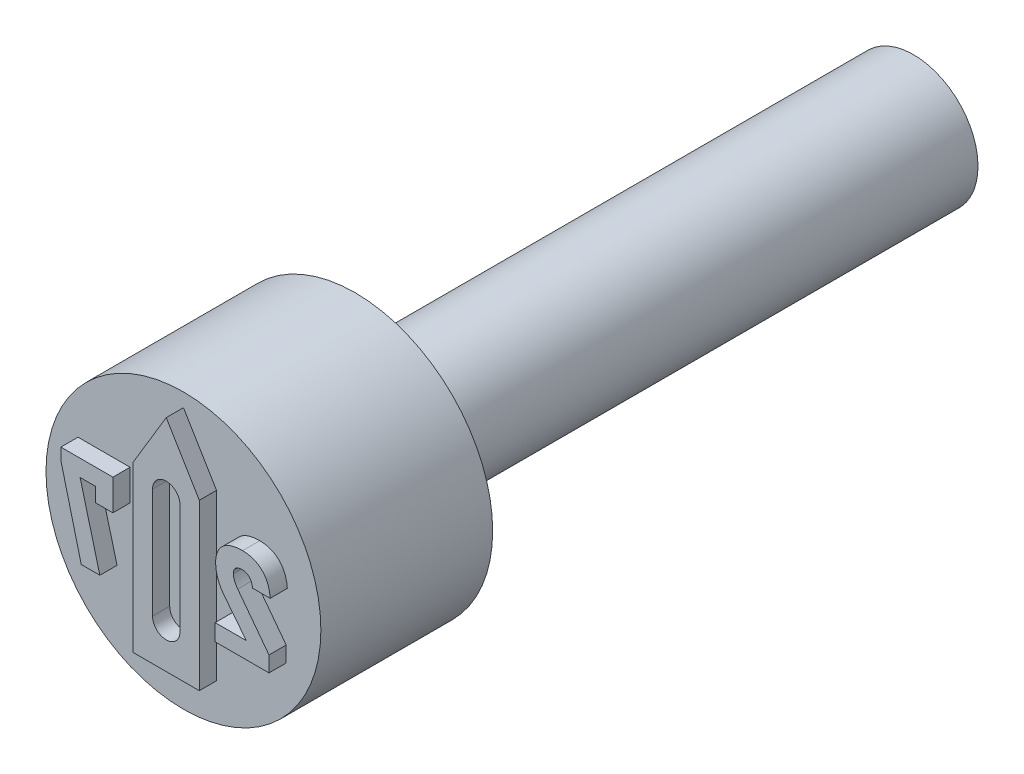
ISO-10303-21;
HEADER;
FILE_DESCRIPTION(('STEP AP214'),'2;1');
FILE_NAME('part.step','',(''),(''),'','','');
FILE_SCHEMA(('AUTOMOTIVE_DESIGN { 1 0 10303 214 1 1 1 1 }'));
ENDSEC;
DATA;
#1=APPLICATION_CONTEXT('core data for automotive mechanical design processes');
#2=APPLICATION_PROTOCOL_DEFINITION('international standard','automotive_design',2000,#1);
#3=PRODUCT_CONTEXT('',#1,'mechanical');
#4=PRODUCT('Part','Part','',(#3));
#5=PRODUCT_RELATED_PRODUCT_CATEGORY('part','',(#4));
#6=PRODUCT_DEFINITION_FORMATION('','',#4);
#7=PRODUCT_DEFINITION_CONTEXT('part definition',#1,'design');
#8=PRODUCT_DEFINITION('design','',#6,#7);
#9=PRODUCT_DEFINITION_SHAPE('','',#8);
#10=(LENGTH_UNIT() NAMED_UNIT(*) SI_UNIT(.MILLI.,.METRE.));
#11=(NAMED_UNIT(*) PLANE_ANGLE_UNIT() SI_UNIT($,.RADIAN.));
#12=(NAMED_UNIT(*) SI_UNIT($,.STERADIAN.) SOLID_ANGLE_UNIT());
#13=UNCERTAINTY_MEASURE_WITH_UNIT(LENGTH_MEASURE(1.E-05),#10,'distance_accuracy_value','');
#14=(GEOMETRIC_REPRESENTATION_CONTEXT(3) GLOBAL_UNCERTAINTY_ASSIGNED_CONTEXT((#13)) GLOBAL_UNIT_ASSIGNED_CONTEXT((#10,
#11,#12)) REPRESENTATION_CONTEXT('',''));
#15=CARTESIAN_POINT('',(0.,0.,0.));
#16=DIRECTION('',(0.,0.,1.));
#17=DIRECTION('',(1.,0.,0.));
#18=AXIS2_PLACEMENT_3D('',#15,#16,#17);
#19=CARTESIAN_POINT('',(0.,3.2,0.));
#20=DIRECTION('',(0.,0.,-1.));
#21=DIRECTION('',(-1.,0.,0.));
#22=AXIS2_PLACEMENT_3D('',#19,#20,#21);
#23=PLANE('',#22);
#24=DIRECTION('',(-1.,0.,0.));
#25=VECTOR('',#24,1.);
#26=CARTESIAN_POINT('',(-1.24250649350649,1.06,0.));
#27=LINE('',#26,#25);
#28=CARTESIAN_POINT('',(-1.24250649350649,1.06,0.));
#29=VERTEX_POINT('',#28);
#30=CARTESIAN_POINT('',(-2.45446266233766,1.06,0.));
#31=VERTEX_POINT('',#30);
#32=EDGE_CURVE('E342',#29,#31,#27,.T.);
#33=ORIENTED_EDGE('',*,*,#32,.F.);
#34=DIRECTION('',(0.,1.,0.));
#35=VECTOR('',#34,1.);
#36=CARTESIAN_POINT('',(-1.24250649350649,0.340779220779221,0.));
#37=LINE('',#36,#35);
#38=CARTESIAN_POINT('',(-1.24250649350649,0.340779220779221,0.));
#39=VERTEX_POINT('',#38);
#40=EDGE_CURVE('E347',#39,#29,#37,.T.);
#41=ORIENTED_EDGE('',*,*,#40,.F.);
#42=DIRECTION('',(1.,0.,0.));
#43=VECTOR('',#42,1.);
#44=CARTESIAN_POINT('',(-1.64231371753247,0.340779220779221,0.));
#45=LINE('',#44,#43);
#46=CARTESIAN_POINT('',(-1.64231371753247,0.340779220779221,0.));
#47=VERTEX_POINT('',#46);
#48=EDGE_CURVE('E384',#47,#39,#45,.T.);
#49=ORIENTED_EDGE('',*,*,#48,.F.);
#50=DIRECTION('',(0.,-1.,0.));
#51=VECTOR('',#50,1.);
#52=CARTESIAN_POINT('',(-1.64231371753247,0.672727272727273,0.));
#53=LINE('',#52,#51);
#54=CARTESIAN_POINT('',(-1.64231371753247,0.672727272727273,0.));
#55=VERTEX_POINT('',#54);
#56=EDGE_CURVE('E381',#55,#47,#53,.T.);
#57=ORIENTED_EDGE('',*,*,#56,.F.);
#58=DIRECTION('',(1.,0.,0.));
#59=VECTOR('',#58,1.);
#60=CARTESIAN_POINT('',(-2.00667857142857,0.672727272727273,0.));
#61=LINE('',#60,#59);
#62=CARTESIAN_POINT('',(-2.00667857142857,0.672727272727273,0.));
#63=VERTEX_POINT('',#62);
#64=EDGE_CURVE('E378',#63,#55,#61,.T.);
#65=ORIENTED_EDGE('',*,*,#64,.F.);
#66=DIRECTION('',(-0.255602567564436,0.966781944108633,0.));
#67=VECTOR('',#66,1.);
#68=CARTESIAN_POINT('',(-1.54592775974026,-1.07,0.));
#69=LINE('',#68,#67);
#70=CARTESIAN_POINT('',(-1.54592775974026,-1.07,0.));
#71=VERTEX_POINT('',#70);
#72=EDGE_CURVE('E375',#71,#63,#69,.T.);
#73=ORIENTED_EDGE('',*,*,#72,.F.);
#74=DIRECTION('',(1.,0.,0.));
#75=VECTOR('',#74,1.);
#76=CARTESIAN_POINT('',(-1.97901623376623,-1.07,0.));
#77=LINE('',#76,#75);
#78=CARTESIAN_POINT('',(-1.97901623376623,-1.07,0.));
#79=VERTEX_POINT('',#78);
#80=EDGE_CURVE('E372',#79,#71,#77,.T.);
#81=ORIENTED_EDGE('',*,*,#80,.F.);
#82=DIRECTION('',(0.247293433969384,-0.968940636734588,0.));
#83=VECTOR('',#82,1.);
#84=CARTESIAN_POINT('',(-2.45446266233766,0.792885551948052,0.));
#85=LINE('',#84,#83);
#86=CARTESIAN_POINT('',(-2.45446266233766,0.792885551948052,0.));
#87=VERTEX_POINT('',#86);
#88=EDGE_CURVE('E369',#87,#79,#85,.T.);
#89=ORIENTED_EDGE('',*,*,#88,.F.);
#90=DIRECTION('',(0.,-1.,0.));
#91=VECTOR('',#90,1.);
#92=CARTESIAN_POINT('',(-2.45446266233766,1.06,0.));
#93=LINE('',#92,#91);
#94=EDGE_CURVE('E366',#31,#87,#93,.T.);
#95=ORIENTED_EDGE('',*,*,#94,.F.);
#96=EDGE_LOOP('',(#33,#41,#49,#57,#65,#73,#81,#89,#95));
#97=FACE_BOUND('',#96,.T.);
#98=CARTESIAN_POINT('',(0.,0.,0.));
#99=DIRECTION('',(0.,0.,1.));
#100=DIRECTION('',(1.,0.,0.));
#101=AXIS2_PLACEMENT_3D('',#98,#99,#100);
#102=CIRCLE('',#101,3.2);
#103=CARTESIAN_POINT('',(3.2,0.,0.));
#104=VERTEX_POINT('',#103);
#105=EDGE_CURVE('E47',#104,#104,#102,.T.);
#106=ORIENTED_EDGE('',*,*,#105,.T.);
#107=EDGE_LOOP('',(#106));
#108=FACE_BOUND('',#107,.T.);
#109=DIRECTION('',(1.,0.,0.));
#110=VECTOR('',#109,1.);
#111=CARTESIAN_POINT('',(1.13792410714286,-1.07,0.));
#112=LINE('',#111,#110);
#113=CARTESIAN_POINT('',(1.13792410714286,-1.07,0.));
#114=VERTEX_POINT('',#113);
#115=CARTESIAN_POINT('',(2.39223823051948,-1.07,0.));
#116=VERTEX_POINT('',#115);
#117=EDGE_CURVE('E415',#114,#116,#112,.T.);
#118=ORIENTED_EDGE('',*,*,#117,.F.);
#119=DIRECTION('',(0.,-1.,0.));
#120=VECTOR('',#119,1.);
#121=CARTESIAN_POINT('',(1.13792410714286,-0.682727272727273,0.));
#122=LINE('',#121,#120);
#123=CARTESIAN_POINT('',(1.13792410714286,-0.682727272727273,0.));
#124=VERTEX_POINT('',#123);
#125=EDGE_CURVE('E420',#124,#114,#122,.T.);
#126=ORIENTED_EDGE('',*,*,#125,.F.);
#127=DIRECTION('',(-1.,0.,0.));
#128=VECTOR('',#127,1.);
#129=CARTESIAN_POINT('',(1.8627637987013,-0.682727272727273,0.));
#130=LINE('',#129,#128);
#131=CARTESIAN_POINT('',(1.8627637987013,-0.682727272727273,0.));
#132=VERTEX_POINT('',#131);
#133=EDGE_CURVE('E677',#132,#124,#130,.T.);
#134=ORIENTED_EDGE('',*,*,#133,.F.);
#135=DIRECTION('',(0.618183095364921,-0.786034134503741,0.));
#136=VECTOR('',#135,1.);
#137=CARTESIAN_POINT('',(1.34063717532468,-0.0188311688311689,0.));
#138=LINE('',#137,#136);
#139=CARTESIAN_POINT('',(1.34063717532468,-0.0188311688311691,0.));
#140=VERTEX_POINT('',#139);
#141=EDGE_CURVE('E671',#140,#132,#138,.T.);
#142=ORIENTED_EDGE('',*,*,#141,.F.);
#143=CARTESIAN_POINT('',(1.14959415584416,0.529228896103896,0.));
#144=CARTESIAN_POINT('',(1.1501452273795,0.5049934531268,0.));
#145=CARTESIAN_POINT('',(1.15124834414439,0.456479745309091,0.));
#146=CARTESIAN_POINT('',(1.16120574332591,0.383872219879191,0.));
#147=CARTESIAN_POINT('',(1.177251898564,0.311635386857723,0.));
#148=CARTESIAN_POINT('',(1.19928893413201,0.240118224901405,0.));
#149=CARTESIAN_POINT('',(1.22666457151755,0.170559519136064,0.));
#150=CARTESIAN_POINT('',(1.25952060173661,0.103911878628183,0.));
#151=CARTESIAN_POINT('',(1.29660284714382,0.0401458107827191,0.));
#152=CARTESIAN_POINT('',(1.32598717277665,0.000790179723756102,0.));
#153=CARTESIAN_POINT('',(1.34063717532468,-0.0188311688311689,0.));
#154=B_SPLINE_CURVE_WITH_KNOTS('',3,(#143,#144,#145,#146,#147,#148,#149,#150,#151,#152,#153),
.UNSPECIFIED.,.F.,.F.,(4,1,1,1,1,1,1,1,4),(0.,0.123046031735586,0.246309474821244,
0.371480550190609,0.498560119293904,0.626024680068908,0.750715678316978,0.875715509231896,1.),.UNSPECIFIED.);
#155=CARTESIAN_POINT('',(1.14959415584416,0.529228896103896,0.));
#156=VERTEX_POINT('',#155);
#157=EDGE_CURVE('E666',#156,#140,#154,.T.);
#158=ORIENTED_EDGE('',*,*,#157,.F.);
#159=DIRECTION('',(0.,-1.,0.));
#160=VECTOR('',#159,1.);
#161=CARTESIAN_POINT('',(1.14959415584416,0.530957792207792,0.));
#162=LINE('',#161,#160);
#163=CARTESIAN_POINT('',(1.14959415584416,0.530957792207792,0.));
#164=VERTEX_POINT('',#163);
#165=EDGE_CURVE('E660',#164,#156,#162,.T.);
#166=ORIENTED_EDGE('',*,*,#165,.F.);
#167=CARTESIAN_POINT('',(1.77675121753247,1.08766233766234,0.));
#168=CARTESIAN_POINT('',(1.75252713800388,1.08731823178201,0.));
#169=CARTESIAN_POINT('',(1.70541450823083,1.08664899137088,0.));
#170=CARTESIAN_POINT('',(1.63682667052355,1.07942474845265,0.));
#171=CARTESIAN_POINT('',(1.57229278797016,1.06852125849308,0.));
#172=CARTESIAN_POINT('',(1.51191670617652,1.05256997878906,0.));
#173=CARTESIAN_POINT('',(1.45594080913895,1.03176294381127,0.));
#174=CARTESIAN_POINT('',(1.40419741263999,1.00667478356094,0.));
#175=CARTESIAN_POINT('',(1.35657835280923,0.977091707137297,0.));
#176=CARTESIAN_POINT('',(1.31344831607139,0.942950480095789,0.));
#177=CARTESIAN_POINT('',(1.27464194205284,0.904871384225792,0.));
#178=CARTESIAN_POINT('',(1.24124012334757,0.862467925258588,0.));
#179=CARTESIAN_POINT('',(1.21232531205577,0.816597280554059,0.));
#180=CARTESIAN_POINT('',(1.18972280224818,0.76636974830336,0.));
#181=CARTESIAN_POINT('',(1.17111459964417,0.712966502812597,0.));
#182=CARTESIAN_POINT('',(1.15906607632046,0.655430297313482,0.));
#183=CARTESIAN_POINT('',(1.15094690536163,0.594438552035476,0.));
#184=CARTESIAN_POINT('',(1.15005221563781,0.55245326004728,0.));
#185=CARTESIAN_POINT('',(1.14959415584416,0.530957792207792,0.));
#186=B_SPLINE_CURVE_WITH_KNOTS('',3,(#167,#168,#169,#170,#171,#172,#173,#174,#175,#176,#177,
#178,#179,#180,#181,#182,#183,#184,#185),.UNSPECIFIED.,.F.,.F.,(4,1,1,1,1,1,1,1,1,1,1,1,1,1,1,1,
4),(0.,0.0762312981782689,0.148259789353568,0.216860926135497,0.282100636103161,
0.344528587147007,0.404571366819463,0.462840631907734,0.520642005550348,0.577409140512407,
0.633580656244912,0.690215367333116,0.747647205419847,0.806597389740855,0.867894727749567,
0.932365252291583,1.),.UNSPECIFIED.);
#187=CARTESIAN_POINT('',(1.77675121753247,1.08766233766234,0.));
#188=VERTEX_POINT('',#187);
#189=EDGE_CURVE('E652',#188,#164,#186,.T.);
#190=ORIENTED_EDGE('',*,*,#189,.F.);
#191=CARTESIAN_POINT('',(2.4186038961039,0.448403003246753,0.));
#192=CARTESIAN_POINT('',(2.41658204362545,0.473092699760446,0.));
#193=CARTESIAN_POINT('',(2.41263542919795,0.521286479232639,0.));
#194=CARTESIAN_POINT('',(2.39969671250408,0.591000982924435,0.));
#195=CARTESIAN_POINT('',(2.38297393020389,0.656667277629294,0.));
#196=CARTESIAN_POINT('',(2.36170029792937,0.718272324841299,0.));
#197=CARTESIAN_POINT('',(2.33436360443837,0.775102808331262,0.));
#198=CARTESIAN_POINT('',(2.30364999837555,0.82834675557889,0.));
#199=CARTESIAN_POINT('',(2.26670922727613,0.876357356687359,0.));
#200=CARTESIAN_POINT('',(2.22627237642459,0.920741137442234,0.));
#201=CARTESIAN_POINT('',(2.18123295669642,0.959833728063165,0.));
#202=CARTESIAN_POINT('',(2.13320856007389,0.994318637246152,0.));
#203=CARTESIAN_POINT('',(2.08147298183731,1.02301566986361,0.));
#204=CARTESIAN_POINT('',(2.02681274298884,1.0468215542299,0.));
#205=CARTESIAN_POINT('',(1.96862181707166,1.06488954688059,0.));
#206=CARTESIAN_POINT('',(1.90766031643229,1.07842384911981,0.));
#207=CARTESIAN_POINT('',(1.84322851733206,1.08622911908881,0.));
#208=CARTESIAN_POINT('',(1.79924774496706,1.08717732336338,0.));
#209=CARTESIAN_POINT('',(1.77675121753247,1.08766233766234,0.));
#210=B_SPLINE_CURVE_WITH_KNOTS('',3,(#191,#192,#193,#194,#195,#196,#197,#198,#199,#200,#201,
#202,#203,#204,#205,#206,#207,#208,#209),.UNSPECIFIED.,.F.,.F.,(4,1,1,1,1,1,1,1,1,1,1,1,1,1,1,1,
4),(0.,0.073326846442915,0.14313249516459,0.209679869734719,0.273918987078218,0.33576228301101,
0.396210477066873,0.45560885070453,0.514796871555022,0.573764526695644,0.631900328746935,
0.689592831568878,0.748648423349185,0.808163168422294,0.86976604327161,0.933384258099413,1.),.UNSPECIFIED.);
#211=CARTESIAN_POINT('',(2.4186038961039,0.448403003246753,0.));
#212=VERTEX_POINT('',#211);
#213=EDGE_CURVE('E647',#212,#188,#210,.T.);
#214=ORIENTED_EDGE('',*,*,#213,.F.);
#215=DIRECTION('',(0.,1.,0.));
#216=VECTOR('',#215,1.);
#217=CARTESIAN_POINT('',(2.4186038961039,0.447106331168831,0.));
#218=LINE('',#217,#216);
#219=CARTESIAN_POINT('',(2.4186038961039,0.447106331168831,0.));
#220=VERTEX_POINT('',#219);
#221=EDGE_CURVE('E644',#220,#212,#218,.T.);
#222=ORIENTED_EDGE('',*,*,#221,.F.);
#223=DIRECTION('',(1.,0.,0.));
#224=VECTOR('',#223,1.);
#225=CARTESIAN_POINT('',(2.00885551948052,0.447106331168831,0.));
#226=LINE('',#225,#224);
#227=CARTESIAN_POINT('',(2.00885551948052,0.447106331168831,0.));
#228=VERTEX_POINT('',#227);
#229=EDGE_CURVE('E641',#228,#220,#226,.T.);
#230=ORIENTED_EDGE('',*,*,#229,.F.);
#231=DIRECTION('',(0.,-1.,0.));
#232=VECTOR('',#231,1.);
#233=CARTESIAN_POINT('',(2.00885551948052,0.448403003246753,0.));
#234=LINE('',#233,#232);
#235=CARTESIAN_POINT('',(2.00885551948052,0.448403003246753,0.));
#236=VERTEX_POINT('',#235);
#237=EDGE_CURVE('E635',#236,#228,#234,.T.);
#238=ORIENTED_EDGE('',*,*,#237,.F.);
#239=CARTESIAN_POINT('',(1.77372564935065,0.70038961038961,0.));
#240=CARTESIAN_POINT('',(1.78938427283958,0.699778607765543,0.));
#241=CARTESIAN_POINT('',(1.81980952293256,0.698591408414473,0.));
#242=CARTESIAN_POINT('',(1.86288164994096,0.68543388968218,0.));
#243=CARTESIAN_POINT('',(1.90169383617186,0.664795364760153,0.));
#244=CARTESIAN_POINT('',(1.93515302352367,0.635346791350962,0.));
#245=CARTESIAN_POINT('',(1.96285976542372,0.598372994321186,0.));
#246=CARTESIAN_POINT('',(1.98534646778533,0.554833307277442,0.));
#247=CARTESIAN_POINT('',(2.00061926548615,0.503941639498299,0.));
#248=CARTESIAN_POINT('',(2.00602176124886,0.467511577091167,0.));
#249=CARTESIAN_POINT('',(2.00885551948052,0.448403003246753,0.));
#250=B_SPLINE_CURVE_WITH_KNOTS('',3,(#239,#240,#241,#242,#243,#244,#245,#246,#247,#248,#249),
.UNSPECIFIED.,.F.,.F.,(4,1,1,1,1,1,1,1,4),(0.,0.122603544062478,0.238222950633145,
0.350089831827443,0.465559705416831,0.58502806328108,0.711014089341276,0.848418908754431,1.),.UNSPECIFIED.);
#251=CARTESIAN_POINT('',(1.77372564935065,0.70038961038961,0.));
#252=VERTEX_POINT('',#251);
#253=EDGE_CURVE('E627',#252,#236,#250,.T.);
#254=ORIENTED_EDGE('',*,*,#253,.F.);
#255=CARTESIAN_POINT('',(1.56107142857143,0.519719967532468,0.));
#256=CARTESIAN_POINT('',(1.56166187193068,0.533338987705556,0.));
#257=CARTESIAN_POINT('',(1.56279306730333,0.559430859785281,0.));
#258=CARTESIAN_POINT('',(1.5734507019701,0.596194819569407,0.));
#259=CARTESIAN_POINT('',(1.59091799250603,0.628210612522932,0.));
#260=CARTESIAN_POINT('',(1.61593536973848,0.654655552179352,0.));
#261=CARTESIAN_POINT('',(1.64708008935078,0.67557190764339,0.));
#262=CARTESIAN_POINT('',(1.68434561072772,0.690312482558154,0.));
#263=CARTESIAN_POINT('',(1.72724434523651,0.698765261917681,0.));
#264=CARTESIAN_POINT('',(1.757693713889,0.699829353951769,0.));
#265=CARTESIAN_POINT('',(1.77372564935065,0.70038961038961,0.));
#266=B_SPLINE_CURVE_WITH_KNOTS('',3,(#255,#256,#257,#258,#259,#260,#261,#262,#263,#264,#265),
.UNSPECIFIED.,.F.,.F.,(4,1,1,1,1,1,1,1,4),(0.,0.128749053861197,0.246662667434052,
0.359069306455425,0.47107757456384,0.588039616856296,0.711712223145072,0.848213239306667,1.),.UNSPECIFIED.);
#267=CARTESIAN_POINT('',(1.56107142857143,0.519719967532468,0.));
#268=VERTEX_POINT('',#267);
#269=EDGE_CURVE('E622',#268,#252,#266,.T.);
#270=ORIENTED_EDGE('',*,*,#269,.F.);
#271=DIRECTION('',(0.,1.,0.));
#272=VECTOR('',#271,1.);
#273=CARTESIAN_POINT('',(1.56107142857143,0.516694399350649,0.));
#274=LINE('',#273,#272);
#275=CARTESIAN_POINT('',(1.56107142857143,0.51669439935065,0.));
#276=VERTEX_POINT('',#275);
#277=EDGE_CURVE('E616',#276,#268,#274,.T.);
#278=ORIENTED_EDGE('',*,*,#277,.F.);
#279=CARTESIAN_POINT('',(1.66437297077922,0.256495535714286,0.));
#280=CARTESIAN_POINT('',(1.64912770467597,0.277976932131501,0.));
#281=CARTESIAN_POINT('',(1.61942276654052,0.319832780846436,0.));
#282=CARTESIAN_POINT('',(1.59253750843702,0.377313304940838,0.));
#283=CARTESIAN_POINT('',(1.575789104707,0.422378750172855,0.));
#284=CARTESIAN_POINT('',(1.56780718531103,0.455060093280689,0.));
#285=CARTESIAN_POINT('',(1.56211313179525,0.486241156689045,0.));
#286=CARTESIAN_POINT('',(1.56141228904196,0.506729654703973,0.));
#287=CARTESIAN_POINT('',(1.56107142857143,0.516694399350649,0.));
#288=B_SPLINE_CURVE_WITH_KNOTS('',3,(#279,#280,#281,#282,#283,#284,#285,#286,#287),
.UNSPECIFIED.,.F.,.F.,(4,1,1,1,1,1,4),(0.,0.27737542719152,0.540457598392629,0.666416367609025,
0.784009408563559,0.894951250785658,1.),.UNSPECIFIED.);
#289=CARTESIAN_POINT('',(1.66437297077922,0.256495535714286,0.));
#290=VERTEX_POINT('',#289);
#291=EDGE_CURVE('E611',#290,#276,#288,.T.);
#292=ORIENTED_EDGE('',*,*,#291,.F.);
#293=DIRECTION('',(-0.602458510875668,0.798150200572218,0.));
#294=VECTOR('',#293,1.);
#295=CARTESIAN_POINT('',(2.39223823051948,-0.707796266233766,0.));
#296=LINE('',#295,#294);
#297=CARTESIAN_POINT('',(2.39223823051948,-0.707796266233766,0.));
#298=VERTEX_POINT('',#297);
#299=EDGE_CURVE('E608',#298,#290,#296,.T.);
#300=ORIENTED_EDGE('',*,*,#299,.F.);
#301=DIRECTION('',(0.,1.,0.));
#302=VECTOR('',#301,1.);
#303=CARTESIAN_POINT('',(2.39223823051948,-1.07,0.));
#304=LINE('',#303,#302);
#305=EDGE_CURVE('E605',#116,#298,#304,.T.);
#306=ORIENTED_EDGE('',*,*,#305,.F.);
#307=EDGE_LOOP('',(#118,#126,#134,#142,#158,#166,#190,#214,#222,#230,#238,#254,#270,#278,#292,
#300,#306));
#308=FACE_BOUND('',#307,.T.);
#309=DIRECTION('',(0.,-1.,0.));
#310=VECTOR('',#309,1.);
#311=CARTESIAN_POINT('',(-0.77,1.6,0.));
#312=LINE('',#311,#310);
#313=CARTESIAN_POINT('',(-0.77,1.6,0.));
#314=VERTEX_POINT('',#313);
#315=CARTESIAN_POINT('',(-0.77,-2.24,0.));
#316=VERTEX_POINT('',#315);
#317=EDGE_CURVE('E301',#314,#316,#312,.T.);
#318=ORIENTED_EDGE('',*,*,#317,.F.);
#319=DIRECTION('',(-0.515038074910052,-0.857167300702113,0.));
#320=VECTOR('',#319,1.);
#321=CARTESIAN_POINT('',(0.,2.88149520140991,0.));
#322=LINE('',#321,#320);
#323=CARTESIAN_POINT('',(0.,2.88149520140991,0.));
#324=VERTEX_POINT('',#323);
#325=EDGE_CURVE('E309',#324,#314,#322,.T.);
#326=ORIENTED_EDGE('',*,*,#325,.F.);
#327=DIRECTION('',(-0.515038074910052,0.857167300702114,0.));
#328=VECTOR('',#327,1.);
#329=CARTESIAN_POINT('',(0.77,1.6,0.));
#330=LINE('',#329,#328);
#331=CARTESIAN_POINT('',(0.77,1.6,0.));
#332=VERTEX_POINT('',#331);
#333=EDGE_CURVE('E324',#332,#324,#330,.T.);
#334=ORIENTED_EDGE('',*,*,#333,.F.);
#335=DIRECTION('',(0.,1.,0.));
#336=VECTOR('',#335,1.);
#337=CARTESIAN_POINT('',(0.77,-2.24,0.));
#338=LINE('',#337,#336);
#339=CARTESIAN_POINT('',(0.77,-2.24,0.));
#340=VERTEX_POINT('',#339);
#341=EDGE_CURVE('E321',#340,#332,#338,.T.);
#342=ORIENTED_EDGE('',*,*,#341,.F.);
#343=DIRECTION('',(1.,0.,0.));
#344=VECTOR('',#343,1.);
#345=CARTESIAN_POINT('',(-0.77,-2.24,0.));
#346=LINE('',#345,#344);
#347=EDGE_CURVE('E62',#316,#340,#346,.T.);
#348=ORIENTED_EDGE('',*,*,#347,.F.);
#349=EDGE_LOOP('',(#318,#326,#334,#342,#348));
#350=FACE_BOUND('',#349,.T.);
#351=ADVANCED_FACE('F39',(#97,#108,#308,#350),#23,.F.);
#352=CARTESIAN_POINT('',(0.,1.5,-4.));
#353=DIRECTION('',(0.,0.,1.));
#354=DIRECTION('',(1.,0.,0.));
#355=AXIS2_PLACEMENT_3D('',#352,#353,#354);
#356=PLANE('',#355);
#357=CARTESIAN_POINT('',(0.,0.,-4.));
#358=DIRECTION('',(0.,0.,1.));
#359=DIRECTION('',(1.,0.,0.));
#360=AXIS2_PLACEMENT_3D('',#357,#358,#359);
#361=CIRCLE('',#360,3.2);
#362=CARTESIAN_POINT('',(3.2,0.,-4.));
#363=VERTEX_POINT('',#362);
#364=EDGE_CURVE('E11',#363,#363,#361,.T.);
#365=ORIENTED_EDGE('',*,*,#364,.F.);
#366=EDGE_LOOP('',(#365));
#367=FACE_BOUND('',#366,.T.);
#368=CARTESIAN_POINT('',(0.,0.,-4.));
#369=DIRECTION('',(0.,0.,1.));
#370=DIRECTION('',(1.,0.,0.));
#371=AXIS2_PLACEMENT_3D('',#368,#369,#370);
#372=CIRCLE('',#371,1.5);
#373=CARTESIAN_POINT('',(1.5,0.,-4.));
#374=VERTEX_POINT('',#373);
#375=EDGE_CURVE('E478',#374,#374,#372,.T.);
#376=ORIENTED_EDGE('',*,*,#375,.T.);
#377=EDGE_LOOP('',(#376));
#378=FACE_BOUND('',#377,.T.);
#379=ADVANCED_FACE('F41',(#367,#378),#356,.F.);
#380=CARTESIAN_POINT('',(0.,0.,-0.403888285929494));
#381=DIRECTION('',(0.,0.,1.));
#382=DIRECTION('',(1.,0.,0.));
#383=AXIS2_PLACEMENT_3D('',#380,#381,#382);
#384=CYLINDRICAL_SURFACE('',#383,3.2);
#385=ORIENTED_EDGE('',*,*,#105,.F.);
#386=EDGE_LOOP('',(#385));
#387=FACE_BOUND('',#386,.T.);
#388=ORIENTED_EDGE('',*,*,#364,.T.);
#389=EDGE_LOOP('',(#388));
#390=FACE_BOUND('',#389,.T.);
#391=ADVANCED_FACE('F461',(#387,#390),#384,.T.);
#392=CARTESIAN_POINT('',(0.,0.,-17.));
#393=DIRECTION('',(0.,0.,1.));
#394=DIRECTION('',(1.,0.,0.));
#395=AXIS2_PLACEMENT_3D('',#392,#393,#394);
#396=PLANE('',#395);
#397=CARTESIAN_POINT('',(0.,0.,-17.));
#398=DIRECTION('',(0.,0.,1.));
#399=DIRECTION('',(1.,0.,0.));
#400=AXIS2_PLACEMENT_3D('',#397,#398,#399);
#401=CIRCLE('',#400,1.5);
#402=CARTESIAN_POINT('',(1.5,0.,-17.));
#403=VERTEX_POINT('',#402);
#404=EDGE_CURVE('E479',#403,#403,#401,.T.);
#405=ORIENTED_EDGE('',*,*,#404,.F.);
#406=EDGE_LOOP('',(#405));
#407=FACE_BOUND('',#406,.T.);
#408=ADVANCED_FACE('F457',(#407),#396,.F.);
#409=CARTESIAN_POINT('',(0.,0.,-0.403888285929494));
#410=DIRECTION('',(0.,0.,1.));
#411=DIRECTION('',(1.,0.,0.));
#412=AXIS2_PLACEMENT_3D('',#409,#410,#411);
#413=CYLINDRICAL_SURFACE('',#412,1.5);
#414=ORIENTED_EDGE('',*,*,#375,.F.);
#415=EDGE_LOOP('',(#414));
#416=FACE_BOUND('',#415,.T.);
#417=ORIENTED_EDGE('',*,*,#404,.T.);
#418=EDGE_LOOP('',(#417));
#419=FACE_BOUND('',#418,.T.);
#420=ADVANCED_FACE('F453',(#416,#419),#413,.T.);
#421=CARTESIAN_POINT('',(1.13792410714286,-1.07,0.4));
#422=DIRECTION('',(0.,1.,0.));
#423=DIRECTION('',(0.,0.,1.));
#424=AXIS2_PLACEMENT_3D('',#421,#422,#423);
#425=PLANE('',#424);
#426=ORIENTED_EDGE('',*,*,#117,.T.);
#427=DIRECTION('',(0.,0.,-1.));
#428=VECTOR('',#427,1.);
#429=CARTESIAN_POINT('',(2.39223823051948,-1.07,0.4));
#430=LINE('',#429,#428);
#431=CARTESIAN_POINT('',(2.39223823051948,-1.07,0.4));
#432=VERTEX_POINT('',#431);
#433=EDGE_CURVE('E480',#432,#116,#430,.T.);
#434=ORIENTED_EDGE('',*,*,#433,.F.);
#435=DIRECTION('',(1.,0.,0.));
#436=VECTOR('',#435,1.);
#437=CARTESIAN_POINT('',(1.13792410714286,-1.07,0.4));
#438=LINE('',#437,#436);
#439=CARTESIAN_POINT('',(1.13792410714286,-1.07,0.4));
#440=VERTEX_POINT('',#439);
#441=EDGE_CURVE('E416',#440,#432,#438,.T.);
#442=ORIENTED_EDGE('',*,*,#441,.F.);
#443=DIRECTION('',(0.,0.,-1.));
#444=VECTOR('',#443,1.);
#445=CARTESIAN_POINT('',(1.13792410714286,-1.07,0.4));
#446=LINE('',#445,#444);
#447=EDGE_CURVE('E603',#440,#114,#446,.T.);
#448=ORIENTED_EDGE('',*,*,#447,.T.);
#449=EDGE_LOOP('',(#426,#434,#442,#448));
#450=FACE_BOUND('',#449,.T.);
#451=ADVANCED_FACE('F449',(#450),#425,.F.);
#452=CARTESIAN_POINT('',(2.39223823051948,-1.07,0.4));
#453=DIRECTION('',(-1.,0.,0.));
#454=DIRECTION('',(0.,0.,1.));
#455=AXIS2_PLACEMENT_3D('',#452,#453,#454);
#456=PLANE('',#455);
#457=ORIENTED_EDGE('',*,*,#305,.T.);
#458=DIRECTION('',(0.,0.,-1.));
#459=VECTOR('',#458,1.);
#460=CARTESIAN_POINT('',(2.39223823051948,-0.707796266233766,0.4));
#461=LINE('',#460,#459);
#462=CARTESIAN_POINT('',(2.39223823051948,-0.707796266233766,0.4));
#463=VERTEX_POINT('',#462);
#464=EDGE_CURVE('E485',#463,#298,#461,.T.);
#465=ORIENTED_EDGE('',*,*,#464,.F.);
#466=DIRECTION('',(0.,1.,0.));
#467=VECTOR('',#466,1.);
#468=CARTESIAN_POINT('',(2.39223823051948,-1.07,0.4));
#469=LINE('',#468,#467);
#470=EDGE_CURVE('E419',#432,#463,#469,.T.);
#471=ORIENTED_EDGE('',*,*,#470,.F.);
#472=ORIENTED_EDGE('',*,*,#433,.T.);
#473=EDGE_LOOP('',(#457,#465,#471,#472));
#474=FACE_BOUND('',#473,.T.);
#475=ADVANCED_FACE('F445',(#474),#456,.F.);
#476=CARTESIAN_POINT('',(2.39223823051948,-0.707796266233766,0.4));
#477=DIRECTION('',(-0.798150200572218,-0.602458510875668,0.));
#478=DIRECTION('',(0.602458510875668,-0.798150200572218,0.));
#479=AXIS2_PLACEMENT_3D('',#476,#477,#478);
#480=PLANE('',#479);
#481=ORIENTED_EDGE('',*,*,#299,.T.);
#482=DIRECTION('',(0.,0.,-1.));
#483=VECTOR('',#482,1.);
#484=CARTESIAN_POINT('',(1.66437297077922,0.256495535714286,0.4));
#485=LINE('',#484,#483);
#486=CARTESIAN_POINT('',(1.66437297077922,0.256495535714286,0.4));
#487=VERTEX_POINT('',#486);
#488=EDGE_CURVE('E722',#487,#290,#485,.T.);
#489=ORIENTED_EDGE('',*,*,#488,.F.);
#490=DIRECTION('',(-0.602458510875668,0.798150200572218,0.));
#491=VECTOR('',#490,1.);
#492=CARTESIAN_POINT('',(2.39223823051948,-0.707796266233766,0.4));
#493=LINE('',#492,#491);
#494=EDGE_CURVE('E422',#463,#487,#493,.T.);
#495=ORIENTED_EDGE('',*,*,#494,.F.);
#496=ORIENTED_EDGE('',*,*,#464,.T.);
#497=EDGE_LOOP('',(#481,#489,#495,#496));
#498=FACE_BOUND('',#497,.T.);
#499=ADVANCED_FACE('F440',(#498),#480,.F.);
#500=CARTESIAN_POINT('',(1.66437297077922,0.256495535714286,0.4));
#501=CARTESIAN_POINT('',(1.64912770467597,0.277976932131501,0.4));
#502=CARTESIAN_POINT('',(1.61942276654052,0.319832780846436,0.4));
#503=CARTESIAN_POINT('',(1.59253750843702,0.377313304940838,0.4));
#504=CARTESIAN_POINT('',(1.575789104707,0.422378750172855,0.4));
#505=CARTESIAN_POINT('',(1.56780718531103,0.455060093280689,0.4));
#506=CARTESIAN_POINT('',(1.56211313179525,0.486241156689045,0.4));
#507=CARTESIAN_POINT('',(1.56141228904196,0.506729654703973,0.4));
#508=CARTESIAN_POINT('',(1.56107142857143,0.516694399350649,0.4));
#509=B_SPLINE_CURVE_WITH_KNOTS('',3,(#500,#501,#502,#503,#504,#505,#506,#507,#508),
.UNSPECIFIED.,.F.,.F.,(4,1,1,1,1,1,4),(0.,0.27737542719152,0.540457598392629,0.666416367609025,
0.784009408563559,0.894951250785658,1.),.UNSPECIFIED.);
#510=DIRECTION('',(0.,0.,-1.));
#511=VECTOR('',#510,1.);
#512=SURFACE_OF_LINEAR_EXTRUSION('',#509,#511);
#513=ORIENTED_EDGE('',*,*,#291,.T.);
#514=DIRECTION('',(0.,0.,-1.));
#515=VECTOR('',#514,1.);
#516=CARTESIAN_POINT('',(1.56107142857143,0.516694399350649,0.4));
#517=LINE('',#516,#515);
#518=CARTESIAN_POINT('',(1.56107142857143,0.516694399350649,0.4));
#519=VERTEX_POINT('',#518);
#520=EDGE_CURVE('E719',#519,#276,#517,.T.);
#521=ORIENTED_EDGE('',*,*,#520,.F.);
#522=EDGE_CURVE('E424',#487,#519,#509,.T.);
#523=ORIENTED_EDGE('',*,*,#522,.F.);
#524=ORIENTED_EDGE('',*,*,#488,.T.);
#525=EDGE_LOOP('',(#513,#521,#523,#524));
#526=FACE_BOUND('',#525,.T.);
#527=ADVANCED_FACE('F435',(#526),#512,.F.);
#528=CARTESIAN_POINT('',(1.56107142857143,0.516694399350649,0.4));
#529=DIRECTION('',(-1.,0.,0.));
#530=DIRECTION('',(0.,0.,1.));
#531=AXIS2_PLACEMENT_3D('',#528,#529,#530);
#532=PLANE('',#531);
#533=ORIENTED_EDGE('',*,*,#277,.T.);
#534=DIRECTION('',(0.,0.,-1.));
#535=VECTOR('',#534,1.);
#536=CARTESIAN_POINT('',(1.56107142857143,0.519719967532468,0.4));
#537=LINE('',#536,#535);
#538=CARTESIAN_POINT('',(1.56107142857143,0.519719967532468,0.4));
#539=VERTEX_POINT('',#538);
#540=EDGE_CURVE('E716',#539,#268,#537,.T.);
#541=ORIENTED_EDGE('',*,*,#540,.F.);
#542=DIRECTION('',(0.,1.,0.));
#543=VECTOR('',#542,1.);
#544=CARTESIAN_POINT('',(1.56107142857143,0.516694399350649,0.4));
#545=LINE('',#544,#543);
#546=EDGE_CURVE('E429',#519,#539,#545,.T.);
#547=ORIENTED_EDGE('',*,*,#546,.F.);
#548=ORIENTED_EDGE('',*,*,#520,.T.);
#549=EDGE_LOOP('',(#533,#541,#547,#548));
#550=FACE_BOUND('',#549,.T.);
#551=ADVANCED_FACE('F439',(#550),#532,.F.);
#552=CARTESIAN_POINT('',(1.56107142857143,0.519719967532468,0.4));
#553=CARTESIAN_POINT('',(1.56166187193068,0.533338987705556,0.4));
#554=CARTESIAN_POINT('',(1.56279306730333,0.559430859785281,0.4));
#555=CARTESIAN_POINT('',(1.5734507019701,0.596194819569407,0.4));
#556=CARTESIAN_POINT('',(1.59091799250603,0.628210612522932,0.4));
#557=CARTESIAN_POINT('',(1.61593536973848,0.654655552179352,0.4));
#558=CARTESIAN_POINT('',(1.64708008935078,0.67557190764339,0.4));
#559=CARTESIAN_POINT('',(1.68434561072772,0.690312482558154,0.4));
#560=CARTESIAN_POINT('',(1.72724434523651,0.698765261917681,0.4));
#561=CARTESIAN_POINT('',(1.757693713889,0.699829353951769,0.4));
#562=CARTESIAN_POINT('',(1.77372564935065,0.70038961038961,0.4));
#563=B_SPLINE_CURVE_WITH_KNOTS('',3,(#552,#553,#554,#555,#556,#557,#558,#559,#560,#561,#562),
.UNSPECIFIED.,.F.,.F.,(4,1,1,1,1,1,1,1,4),(0.,0.128749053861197,0.246662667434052,
0.359069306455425,0.47107757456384,0.588039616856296,0.711712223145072,0.848213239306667,1.),.UNSPECIFIED.);
#564=DIRECTION('',(0.,0.,-1.));
#565=VECTOR('',#564,1.);
#566=SURFACE_OF_LINEAR_EXTRUSION('',#563,#565);
#567=ORIENTED_EDGE('',*,*,#269,.T.);
#568=DIRECTION('',(0.,0.,-1.));
#569=VECTOR('',#568,1.);
#570=CARTESIAN_POINT('',(1.77372564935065,0.70038961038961,0.4));
#571=LINE('',#570,#569);
#572=CARTESIAN_POINT('',(1.77372564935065,0.70038961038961,0.4));
#573=VERTEX_POINT('',#572);
#574=EDGE_CURVE('E713',#573,#252,#571,.T.);
#575=ORIENTED_EDGE('',*,*,#574,.F.);
#576=EDGE_CURVE('E735',#539,#573,#563,.T.);
#577=ORIENTED_EDGE('',*,*,#576,.F.);
#578=ORIENTED_EDGE('',*,*,#540,.T.);
#579=EDGE_LOOP('',(#567,#575,#577,#578));
#580=FACE_BOUND('',#579,.T.);
#581=ADVANCED_FACE('F750',(#580),#566,.F.);
#582=CARTESIAN_POINT('',(1.77372564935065,0.70038961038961,0.4));
#583=CARTESIAN_POINT('',(1.78938427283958,0.699778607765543,0.4));
#584=CARTESIAN_POINT('',(1.81980952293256,0.698591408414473,0.4));
#585=CARTESIAN_POINT('',(1.86288164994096,0.68543388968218,0.4));
#586=CARTESIAN_POINT('',(1.90169383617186,0.664795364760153,0.4));
#587=CARTESIAN_POINT('',(1.93515302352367,0.635346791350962,0.4));
#588=CARTESIAN_POINT('',(1.96285976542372,0.598372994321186,0.4));
#589=CARTESIAN_POINT('',(1.98534646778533,0.554833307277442,0.4));
#590=CARTESIAN_POINT('',(2.00061926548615,0.503941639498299,0.4));
#591=CARTESIAN_POINT('',(2.00602176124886,0.467511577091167,0.4));
#592=CARTESIAN_POINT('',(2.00885551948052,0.448403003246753,0.4));
#593=B_SPLINE_CURVE_WITH_KNOTS('',3,(#582,#583,#584,#585,#586,#587,#588,#589,#590,#591,#592),
.UNSPECIFIED.,.F.,.F.,(4,1,1,1,1,1,1,1,4),(0.,0.122603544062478,0.238222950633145,
0.350089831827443,0.465559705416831,0.58502806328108,0.711014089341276,0.848418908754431,1.),.UNSPECIFIED.);
#594=DIRECTION('',(0.,0.,-1.));
#595=VECTOR('',#594,1.);
#596=SURFACE_OF_LINEAR_EXTRUSION('',#593,#595);
#597=ORIENTED_EDGE('',*,*,#253,.T.);
#598=DIRECTION('',(0.,0.,-1.));
#599=VECTOR('',#598,1.);
#600=CARTESIAN_POINT('',(2.00885551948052,0.448403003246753,0.4));
#601=LINE('',#600,#599);
#602=CARTESIAN_POINT('',(2.00885551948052,0.448403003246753,0.4));
#603=VERTEX_POINT('',#602);
#604=EDGE_CURVE('E710',#603,#236,#601,.T.);
#605=ORIENTED_EDGE('',*,*,#604,.F.);
#606=EDGE_CURVE('E736',#573,#603,#593,.T.);
#607=ORIENTED_EDGE('',*,*,#606,.F.);
#608=ORIENTED_EDGE('',*,*,#574,.T.);
#609=EDGE_LOOP('',(#597,#605,#607,#608));
#610=FACE_BOUND('',#609,.T.);
#611=ADVANCED_FACE('F753',(#610),#596,.F.);
#612=CARTESIAN_POINT('',(2.00885551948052,0.448403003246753,0.4));
#613=DIRECTION('',(1.,0.,0.));
#614=DIRECTION('',(0.,0.,-1.));
#615=AXIS2_PLACEMENT_3D('',#612,#613,#614);
#616=PLANE('',#615);
#617=ORIENTED_EDGE('',*,*,#237,.T.);
#618=DIRECTION('',(0.,0.,-1.));
#619=VECTOR('',#618,1.);
#620=CARTESIAN_POINT('',(2.00885551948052,0.447106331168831,0.4));
#621=LINE('',#620,#619);
#622=CARTESIAN_POINT('',(2.00885551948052,0.447106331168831,0.4));
#623=VERTEX_POINT('',#622);
#624=EDGE_CURVE('E707',#623,#228,#621,.T.);
#625=ORIENTED_EDGE('',*,*,#624,.F.);
#626=DIRECTION('',(0.,-1.,0.));
#627=VECTOR('',#626,1.);
#628=CARTESIAN_POINT('',(2.00885551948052,0.448403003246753,0.4));
#629=LINE('',#628,#627);
#630=EDGE_CURVE('E738',#603,#623,#629,.T.);
#631=ORIENTED_EDGE('',*,*,#630,.F.);
#632=ORIENTED_EDGE('',*,*,#604,.T.);
#633=EDGE_LOOP('',(#617,#625,#631,#632));
#634=FACE_BOUND('',#633,.T.);
#635=ADVANCED_FACE('F757',(#634),#616,.F.);
#636=CARTESIAN_POINT('',(2.00885551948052,0.447106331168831,0.4));
#637=DIRECTION('',(0.,1.,0.));
#638=DIRECTION('',(0.,0.,1.));
#639=AXIS2_PLACEMENT_3D('',#636,#637,#638);
#640=PLANE('',#639);
#641=ORIENTED_EDGE('',*,*,#229,.T.);
#642=DIRECTION('',(0.,0.,-1.));
#643=VECTOR('',#642,1.);
#644=CARTESIAN_POINT('',(2.4186038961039,0.447106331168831,0.4));
#645=LINE('',#644,#643);
#646=CARTESIAN_POINT('',(2.4186038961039,0.447106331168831,0.4));
#647=VERTEX_POINT('',#646);
#648=EDGE_CURVE('E704',#647,#220,#645,.T.);
#649=ORIENTED_EDGE('',*,*,#648,.F.);
#650=DIRECTION('',(1.,0.,0.));
#651=VECTOR('',#650,1.);
#652=CARTESIAN_POINT('',(2.00885551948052,0.447106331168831,0.4));
#653=LINE('',#652,#651);
#654=EDGE_CURVE('E813',#623,#647,#653,.T.);
#655=ORIENTED_EDGE('',*,*,#654,.F.);
#656=ORIENTED_EDGE('',*,*,#624,.T.);
#657=EDGE_LOOP('',(#641,#649,#655,#656));
#658=FACE_BOUND('',#657,.T.);
#659=ADVANCED_FACE('F761',(#658),#640,.F.);
#660=CARTESIAN_POINT('',(2.4186038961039,0.447106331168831,0.4));
#661=DIRECTION('',(-1.,0.,0.));
#662=DIRECTION('',(0.,0.,1.));
#663=AXIS2_PLACEMENT_3D('',#660,#661,#662);
#664=PLANE('',#663);
#665=ORIENTED_EDGE('',*,*,#221,.T.);
#666=DIRECTION('',(0.,0.,-1.));
#667=VECTOR('',#666,1.);
#668=CARTESIAN_POINT('',(2.4186038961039,0.448403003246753,0.4));
#669=LINE('',#668,#667);
#670=CARTESIAN_POINT('',(2.4186038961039,0.448403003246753,0.4));
#671=VERTEX_POINT('',#670);
#672=EDGE_CURVE('E701',#671,#212,#669,.T.);
#673=ORIENTED_EDGE('',*,*,#672,.F.);
#674=DIRECTION('',(0.,1.,0.));
#675=VECTOR('',#674,1.);
#676=CARTESIAN_POINT('',(2.4186038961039,0.447106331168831,0.4));
#677=LINE('',#676,#675);
#678=EDGE_CURVE('E781',#647,#671,#677,.T.);
#679=ORIENTED_EDGE('',*,*,#678,.F.);
#680=ORIENTED_EDGE('',*,*,#648,.T.);
#681=EDGE_LOOP('',(#665,#673,#679,#680));
#682=FACE_BOUND('',#681,.T.);
#683=ADVANCED_FACE('F765',(#682),#664,.F.);
#684=CARTESIAN_POINT('',(2.4186038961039,0.448403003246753,0.4));
#685=CARTESIAN_POINT('',(2.41658204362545,0.473092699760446,0.4));
#686=CARTESIAN_POINT('',(2.41263542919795,0.521286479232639,0.4));
#687=CARTESIAN_POINT('',(2.39969671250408,0.591000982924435,0.4));
#688=CARTESIAN_POINT('',(2.38297393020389,0.656667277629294,0.4));
#689=CARTESIAN_POINT('',(2.36170029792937,0.718272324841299,0.4));
#690=CARTESIAN_POINT('',(2.33436360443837,0.775102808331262,0.4));
#691=CARTESIAN_POINT('',(2.30364999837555,0.82834675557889,0.4));
#692=CARTESIAN_POINT('',(2.26670922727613,0.876357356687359,0.4));
#693=CARTESIAN_POINT('',(2.22627237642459,0.920741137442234,0.4));
#694=CARTESIAN_POINT('',(2.18123295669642,0.959833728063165,0.4));
#695=CARTESIAN_POINT('',(2.13320856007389,0.994318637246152,0.4));
#696=CARTESIAN_POINT('',(2.08147298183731,1.02301566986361,0.4));
#697=CARTESIAN_POINT('',(2.02681274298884,1.0468215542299,0.4));
#698=CARTESIAN_POINT('',(1.96862181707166,1.06488954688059,0.4));
#699=CARTESIAN_POINT('',(1.90766031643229,1.07842384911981,0.4));
#700=CARTESIAN_POINT('',(1.84322851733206,1.08622911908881,0.4));
#701=CARTESIAN_POINT('',(1.79924774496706,1.08717732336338,0.4));
#702=CARTESIAN_POINT('',(1.77675121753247,1.08766233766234,0.4));
#703=B_SPLINE_CURVE_WITH_KNOTS('',3,(#684,#685,#686,#687,#688,#689,#690,#691,#692,#693,#694,
#695,#696,#697,#698,#699,#700,#701,#702),.UNSPECIFIED.,.F.,.F.,(4,1,1,1,1,1,1,1,1,1,1,1,1,1,1,1,
4),(0.,0.073326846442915,0.14313249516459,0.209679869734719,0.273918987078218,0.33576228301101,
0.396210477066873,0.45560885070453,0.514796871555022,0.573764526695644,0.631900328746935,
0.689592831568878,0.748648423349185,0.808163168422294,0.86976604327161,0.933384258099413,1.),.UNSPECIFIED.);
#704=DIRECTION('',(0.,0.,-1.));
#705=VECTOR('',#704,1.);
#706=SURFACE_OF_LINEAR_EXTRUSION('',#703,#705);
#707=ORIENTED_EDGE('',*,*,#213,.T.);
#708=DIRECTION('',(0.,0.,-1.));
#709=VECTOR('',#708,1.);
#710=CARTESIAN_POINT('',(1.77675121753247,1.08766233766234,0.4));
#711=LINE('',#710,#709);
#712=CARTESIAN_POINT('',(1.77675121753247,1.08766233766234,0.4));
#713=VERTEX_POINT('',#712);
#714=EDGE_CURVE('E698',#713,#188,#711,.T.);
#715=ORIENTED_EDGE('',*,*,#714,.F.);
#716=EDGE_CURVE('E775',#671,#713,#703,.T.);
#717=ORIENTED_EDGE('',*,*,#716,.F.);
#718=ORIENTED_EDGE('',*,*,#672,.T.);
#719=EDGE_LOOP('',(#707,#715,#717,#718));
#720=FACE_BOUND('',#719,.T.);
#721=ADVANCED_FACE('F769',(#720),#706,.F.);
#722=CARTESIAN_POINT('',(1.77675121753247,1.08766233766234,0.4));
#723=CARTESIAN_POINT('',(1.75252713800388,1.08731823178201,0.4));
#724=CARTESIAN_POINT('',(1.70541450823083,1.08664899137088,0.4));
#725=CARTESIAN_POINT('',(1.63682667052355,1.07942474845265,0.4));
#726=CARTESIAN_POINT('',(1.57229278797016,1.06852125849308,0.4));
#727=CARTESIAN_POINT('',(1.51191670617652,1.05256997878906,0.4));
#728=CARTESIAN_POINT('',(1.45594080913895,1.03176294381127,0.4));
#729=CARTESIAN_POINT('',(1.40419741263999,1.00667478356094,0.4));
#730=CARTESIAN_POINT('',(1.35657835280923,0.977091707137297,0.4));
#731=CARTESIAN_POINT('',(1.31344831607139,0.942950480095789,0.4));
#732=CARTESIAN_POINT('',(1.27464194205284,0.904871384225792,0.4));
#733=CARTESIAN_POINT('',(1.24124012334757,0.862467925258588,0.4));
#734=CARTESIAN_POINT('',(1.21232531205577,0.816597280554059,0.4));
#735=CARTESIAN_POINT('',(1.18972280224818,0.76636974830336,0.4));
#736=CARTESIAN_POINT('',(1.17111459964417,0.712966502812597,0.4));
#737=CARTESIAN_POINT('',(1.15906607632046,0.655430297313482,0.4));
#738=CARTESIAN_POINT('',(1.15094690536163,0.594438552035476,0.4));
#739=CARTESIAN_POINT('',(1.15005221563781,0.55245326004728,0.4));
#740=CARTESIAN_POINT('',(1.14959415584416,0.530957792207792,0.4));
#741=B_SPLINE_CURVE_WITH_KNOTS('',3,(#722,#723,#724,#725,#726,#727,#728,#729,#730,#731,#732,
#733,#734,#735,#736,#737,#738,#739,#740),.UNSPECIFIED.,.F.,.F.,(4,1,1,1,1,1,1,1,1,1,1,1,1,1,1,1,
4),(0.,0.0762312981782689,0.148259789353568,0.216860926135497,0.282100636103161,
0.344528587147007,0.404571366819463,0.462840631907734,0.520642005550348,0.577409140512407,
0.633580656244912,0.690215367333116,0.747647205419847,0.806597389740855,0.867894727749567,
0.932365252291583,1.),.UNSPECIFIED.);
#742=DIRECTION('',(0.,0.,-1.));
#743=VECTOR('',#742,1.);
#744=SURFACE_OF_LINEAR_EXTRUSION('',#741,#743);
#745=ORIENTED_EDGE('',*,*,#189,.T.);
#746=DIRECTION('',(0.,0.,-1.));
#747=VECTOR('',#746,1.);
#748=CARTESIAN_POINT('',(1.14959415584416,0.530957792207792,0.4));
#749=LINE('',#748,#747);
#750=CARTESIAN_POINT('',(1.14959415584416,0.530957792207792,0.4));
#751=VERTEX_POINT('',#750);
#752=EDGE_CURVE('E695',#751,#164,#749,.T.);
#753=ORIENTED_EDGE('',*,*,#752,.F.);
#754=EDGE_CURVE('E780',#713,#751,#741,.T.);
#755=ORIENTED_EDGE('',*,*,#754,.F.);
#756=ORIENTED_EDGE('',*,*,#714,.T.);
#757=EDGE_LOOP('',(#745,#753,#755,#756));
#758=FACE_BOUND('',#757,.T.);
#759=ADVANCED_FACE('F773',(#758),#744,.F.);
#760=CARTESIAN_POINT('',(1.14959415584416,0.530957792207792,0.4));
#761=DIRECTION('',(1.,0.,0.));
#762=DIRECTION('',(0.,0.,-1.));
#763=AXIS2_PLACEMENT_3D('',#760,#761,#762);
#764=PLANE('',#763);
#765=ORIENTED_EDGE('',*,*,#165,.T.);
#766=DIRECTION('',(0.,0.,-1.));
#767=VECTOR('',#766,1.);
#768=CARTESIAN_POINT('',(1.14959415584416,0.529228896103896,0.4));
#769=LINE('',#768,#767);
#770=CARTESIAN_POINT('',(1.14959415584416,0.529228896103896,0.4));
#771=VERTEX_POINT('',#770);
#772=EDGE_CURVE('E692',#771,#156,#769,.T.);
#773=ORIENTED_EDGE('',*,*,#772,.F.);
#774=DIRECTION('',(0.,-1.,0.));
#775=VECTOR('',#774,1.);
#776=CARTESIAN_POINT('',(1.14959415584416,0.530957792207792,0.4));
#777=LINE('',#776,#775);
#778=EDGE_CURVE('E593',#751,#771,#777,.T.);
#779=ORIENTED_EDGE('',*,*,#778,.F.);
#780=ORIENTED_EDGE('',*,*,#752,.T.);
#781=EDGE_LOOP('',(#765,#773,#779,#780));
#782=FACE_BOUND('',#781,.T.);
#783=ADVANCED_FACE('F583',(#782),#764,.F.);
#784=CARTESIAN_POINT('',(1.14959415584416,0.529228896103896,0.4));
#785=CARTESIAN_POINT('',(1.1501452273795,0.5049934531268,0.4));
#786=CARTESIAN_POINT('',(1.15124834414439,0.456479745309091,0.4));
#787=CARTESIAN_POINT('',(1.16120574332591,0.383872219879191,0.4));
#788=CARTESIAN_POINT('',(1.177251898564,0.311635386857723,0.4));
#789=CARTESIAN_POINT('',(1.19928893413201,0.240118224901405,0.4));
#790=CARTESIAN_POINT('',(1.22666457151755,0.170559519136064,0.4));
#791=CARTESIAN_POINT('',(1.25952060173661,0.103911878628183,0.4));
#792=CARTESIAN_POINT('',(1.29660284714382,0.0401458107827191,0.4));
#793=CARTESIAN_POINT('',(1.32598717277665,0.000790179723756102,0.4));
#794=CARTESIAN_POINT('',(1.34063717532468,-0.0188311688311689,0.4));
#795=B_SPLINE_CURVE_WITH_KNOTS('',3,(#784,#785,#786,#787,#788,#789,#790,#791,#792,#793,#794),
.UNSPECIFIED.,.F.,.F.,(4,1,1,1,1,1,1,1,4),(0.,0.123046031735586,0.246309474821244,
0.371480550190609,0.498560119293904,0.626024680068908,0.750715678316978,0.875715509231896,1.),.UNSPECIFIED.);
#796=DIRECTION('',(0.,0.,-1.));
#797=VECTOR('',#796,1.);
#798=SURFACE_OF_LINEAR_EXTRUSION('',#795,#797);
#799=ORIENTED_EDGE('',*,*,#157,.T.);
#800=DIRECTION('',(0.,0.,-1.));
#801=VECTOR('',#800,1.);
#802=CARTESIAN_POINT('',(1.34063717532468,-0.0188311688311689,0.4));
#803=LINE('',#802,#801);
#804=CARTESIAN_POINT('',(1.34063717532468,-0.0188311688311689,0.4));
#805=VERTEX_POINT('',#804);
#806=EDGE_CURVE('E689',#805,#140,#803,.T.);
#807=ORIENTED_EDGE('',*,*,#806,.F.);
#808=EDGE_CURVE('E586',#771,#805,#795,.T.);
#809=ORIENTED_EDGE('',*,*,#808,.F.);
#810=ORIENTED_EDGE('',*,*,#772,.T.);
#811=EDGE_LOOP('',(#799,#807,#809,#810));
#812=FACE_BOUND('',#811,.T.);
#813=ADVANCED_FACE('F578',(#812),#798,.F.);
#814=CARTESIAN_POINT('',(1.34063717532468,-0.0188311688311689,0.4));
#815=DIRECTION('',(0.786034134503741,0.618183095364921,0.));
#816=DIRECTION('',(-0.618183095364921,0.786034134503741,0.));
#817=AXIS2_PLACEMENT_3D('',#814,#815,#816);
#818=PLANE('',#817);
#819=ORIENTED_EDGE('',*,*,#141,.T.);
#820=DIRECTION('',(0.,0.,-1.));
#821=VECTOR('',#820,1.);
#822=CARTESIAN_POINT('',(1.8627637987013,-0.682727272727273,0.4));
#823=LINE('',#822,#821);
#824=CARTESIAN_POINT('',(1.8627637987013,-0.682727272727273,0.4));
#825=VERTEX_POINT('',#824);
#826=EDGE_CURVE('E686',#825,#132,#823,.T.);
#827=ORIENTED_EDGE('',*,*,#826,.F.);
#828=DIRECTION('',(0.618183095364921,-0.786034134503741,0.));
#829=VECTOR('',#828,1.);
#830=CARTESIAN_POINT('',(1.34063717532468,-0.0188311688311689,0.4));
#831=LINE('',#830,#829);
#832=EDGE_CURVE('E592',#805,#825,#831,.T.);
#833=ORIENTED_EDGE('',*,*,#832,.F.);
#834=ORIENTED_EDGE('',*,*,#806,.T.);
#835=EDGE_LOOP('',(#819,#827,#833,#834));
#836=FACE_BOUND('',#835,.T.);
#837=ADVANCED_FACE('F574',(#836),#818,.F.);
#838=CARTESIAN_POINT('',(1.8627637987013,-0.682727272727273,0.4));
#839=DIRECTION('',(0.,-1.,0.));
#840=DIRECTION('',(0.,0.,-1.));
#841=AXIS2_PLACEMENT_3D('',#838,#839,#840);
#842=PLANE('',#841);
#843=ORIENTED_EDGE('',*,*,#133,.T.);
#844=DIRECTION('',(0.,0.,-1.));
#845=VECTOR('',#844,1.);
#846=CARTESIAN_POINT('',(1.13792410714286,-0.682727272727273,0.4));
#847=LINE('',#846,#845);
#848=CARTESIAN_POINT('',(1.13792410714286,-0.682727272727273,0.4));
#849=VERTEX_POINT('',#848);
#850=EDGE_CURVE('E683',#849,#124,#847,.T.);
#851=ORIENTED_EDGE('',*,*,#850,.F.);
#852=DIRECTION('',(-1.,0.,0.));
#853=VECTOR('',#852,1.);
#854=CARTESIAN_POINT('',(1.8627637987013,-0.682727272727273,0.4));
#855=LINE('',#854,#853);
#856=EDGE_CURVE('E599',#825,#849,#855,.T.);
#857=ORIENTED_EDGE('',*,*,#856,.F.);
#858=ORIENTED_EDGE('',*,*,#826,.T.);
#859=EDGE_LOOP('',(#843,#851,#857,#858));
#860=FACE_BOUND('',#859,.T.);
#861=ADVANCED_FACE('F570',(#860),#842,.F.);
#862=CARTESIAN_POINT('',(1.13792410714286,-0.682727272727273,0.4));
#863=DIRECTION('',(1.,0.,0.));
#864=DIRECTION('',(0.,0.,-1.));
#865=AXIS2_PLACEMENT_3D('',#862,#863,#864);
#866=PLANE('',#865);
#867=ORIENTED_EDGE('',*,*,#125,.T.);
#868=ORIENTED_EDGE('',*,*,#447,.F.);
#869=DIRECTION('',(0.,-1.,0.));
#870=VECTOR('',#869,1.);
#871=CARTESIAN_POINT('',(1.13792410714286,-0.682727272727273,0.4));
#872=LINE('',#871,#870);
#873=EDGE_CURVE('E601',#849,#440,#872,.T.);
#874=ORIENTED_EDGE('',*,*,#873,.F.);
#875=ORIENTED_EDGE('',*,*,#850,.T.);
#876=EDGE_LOOP('',(#867,#868,#874,#875));
#877=FACE_BOUND('',#876,.T.);
#878=ADVANCED_FACE('F566',(#877),#866,.F.);
#879=CARTESIAN_POINT('',(1.59269422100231,0.378966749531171,0.4));
#880=DIRECTION('',(0.,0.,1.));
#881=DIRECTION('',(1.,0.,0.));
#882=AXIS2_PLACEMENT_3D('',#879,#880,#881);
#883=PLANE('',#882);
#884=ORIENTED_EDGE('',*,*,#441,.T.);
#885=ORIENTED_EDGE('',*,*,#470,.T.);
#886=ORIENTED_EDGE('',*,*,#494,.T.);
#887=ORIENTED_EDGE('',*,*,#522,.T.);
#888=ORIENTED_EDGE('',*,*,#546,.T.);
#889=ORIENTED_EDGE('',*,*,#576,.T.);
#890=ORIENTED_EDGE('',*,*,#606,.T.);
#891=ORIENTED_EDGE('',*,*,#630,.T.);
#892=ORIENTED_EDGE('',*,*,#654,.T.);
#893=ORIENTED_EDGE('',*,*,#678,.T.);
#894=ORIENTED_EDGE('',*,*,#716,.T.);
#895=ORIENTED_EDGE('',*,*,#754,.T.);
#896=ORIENTED_EDGE('',*,*,#778,.T.);
#897=ORIENTED_EDGE('',*,*,#808,.T.);
#898=ORIENTED_EDGE('',*,*,#832,.T.);
#899=ORIENTED_EDGE('',*,*,#856,.T.);
#900=ORIENTED_EDGE('',*,*,#873,.T.);
#901=EDGE_LOOP('',(#884,#885,#886,#887,#888,#889,#890,#891,#892,#893,#894,#895,#896,#897,#898,
#899,#900));
#902=FACE_BOUND('',#901,.T.);
#903=ADVANCED_FACE('F562',(#902),#883,.T.);
#904=CARTESIAN_POINT('',(-1.24250649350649,1.06,0.4));
#905=DIRECTION('',(0.,-1.,0.));
#906=DIRECTION('',(0.,0.,-1.));
#907=AXIS2_PLACEMENT_3D('',#904,#905,#906);
#908=PLANE('',#907);
#909=ORIENTED_EDGE('',*,*,#32,.T.);
#910=DIRECTION('',(0.,0.,-1.));
#911=VECTOR('',#910,1.);
#912=CARTESIAN_POINT('',(-2.45446266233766,1.06,0.4));
#913=LINE('',#912,#911);
#914=CARTESIAN_POINT('',(-2.45446266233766,1.06,0.4));
#915=VERTEX_POINT('',#914);
#916=EDGE_CURVE('E412',#915,#31,#913,.T.);
#917=ORIENTED_EDGE('',*,*,#916,.F.);
#918=DIRECTION('',(-1.,0.,0.));
#919=VECTOR('',#918,1.);
#920=CARTESIAN_POINT('',(-1.24250649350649,1.06,0.4));
#921=LINE('',#920,#919);
#922=CARTESIAN_POINT('',(-1.24250649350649,1.06,0.4));
#923=VERTEX_POINT('',#922);
#924=EDGE_CURVE('E343',#923,#915,#921,.T.);
#925=ORIENTED_EDGE('',*,*,#924,.F.);
#926=DIRECTION('',(0.,0.,-1.));
#927=VECTOR('',#926,1.);
#928=CARTESIAN_POINT('',(-1.24250649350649,1.06,0.4));
#929=LINE('',#928,#927);
#930=EDGE_CURVE('E363',#923,#29,#929,.T.);
#931=ORIENTED_EDGE('',*,*,#930,.T.);
#932=EDGE_LOOP('',(#909,#917,#925,#931));
#933=FACE_BOUND('',#932,.T.);
#934=ADVANCED_FACE('F558',(#933),#908,.F.);
#935=CARTESIAN_POINT('',(-2.45446266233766,1.06,0.4));
#936=DIRECTION('',(1.,0.,0.));
#937=DIRECTION('',(0.,0.,-1.));
#938=AXIS2_PLACEMENT_3D('',#935,#936,#937);
#939=PLANE('',#938);
#940=ORIENTED_EDGE('',*,*,#94,.T.);
#941=DIRECTION('',(0.,0.,-1.));
#942=VECTOR('',#941,1.);
#943=CARTESIAN_POINT('',(-2.45446266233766,0.792885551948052,0.4));
#944=LINE('',#943,#942);
#945=CARTESIAN_POINT('',(-2.45446266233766,0.792885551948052,0.4));
#946=VERTEX_POINT('',#945);
#947=EDGE_CURVE('E409',#946,#87,#944,.T.);
#948=ORIENTED_EDGE('',*,*,#947,.F.);
#949=DIRECTION('',(0.,-1.,0.));
#950=VECTOR('',#949,1.);
#951=CARTESIAN_POINT('',(-2.45446266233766,1.06,0.4));
#952=LINE('',#951,#950);
#953=EDGE_CURVE('E346',#915,#946,#952,.T.);
#954=ORIENTED_EDGE('',*,*,#953,.F.);
#955=ORIENTED_EDGE('',*,*,#916,.T.);
#956=EDGE_LOOP('',(#940,#948,#954,#955));
#957=FACE_BOUND('',#956,.T.);
#958=ADVANCED_FACE('F554',(#957),#939,.F.);
#959=CARTESIAN_POINT('',(-2.45446266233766,0.792885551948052,0.4));
#960=DIRECTION('',(0.968940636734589,0.247293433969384,0.));
#961=DIRECTION('',(-0.247293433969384,0.968940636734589,0.));
#962=AXIS2_PLACEMENT_3D('',#959,#960,#961);
#963=PLANE('',#962);
#964=ORIENTED_EDGE('',*,*,#88,.T.);
#965=DIRECTION('',(0.,0.,-1.));
#966=VECTOR('',#965,1.);
#967=CARTESIAN_POINT('',(-1.97901623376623,-1.07,0.4));
#968=LINE('',#967,#966);
#969=CARTESIAN_POINT('',(-1.97901623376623,-1.07,0.4));
#970=VERTEX_POINT('',#969);
#971=EDGE_CURVE('E406',#970,#79,#968,.T.);
#972=ORIENTED_EDGE('',*,*,#971,.F.);
#973=DIRECTION('',(0.247293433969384,-0.968940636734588,0.));
#974=VECTOR('',#973,1.);
#975=CARTESIAN_POINT('',(-2.45446266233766,0.792885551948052,0.4));
#976=LINE('',#975,#974);
#977=EDGE_CURVE('E349',#946,#970,#976,.T.);
#978=ORIENTED_EDGE('',*,*,#977,.F.);
#979=ORIENTED_EDGE('',*,*,#947,.T.);
#980=EDGE_LOOP('',(#964,#972,#978,#979));
#981=FACE_BOUND('',#980,.T.);
#982=ADVANCED_FACE('F550',(#981),#963,.F.);
#983=CARTESIAN_POINT('',(-1.97901623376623,-1.07,0.4));
#984=DIRECTION('',(0.,1.,0.));
#985=DIRECTION('',(0.,0.,1.));
#986=AXIS2_PLACEMENT_3D('',#983,#984,#985);
#987=PLANE('',#986);
#988=ORIENTED_EDGE('',*,*,#80,.T.);
#989=DIRECTION('',(0.,0.,-1.));
#990=VECTOR('',#989,1.);
#991=CARTESIAN_POINT('',(-1.54592775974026,-1.07,0.4));
#992=LINE('',#991,#990);
#993=CARTESIAN_POINT('',(-1.54592775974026,-1.07,0.4));
#994=VERTEX_POINT('',#993);
#995=EDGE_CURVE('E403',#994,#71,#992,.T.);
#996=ORIENTED_EDGE('',*,*,#995,.F.);
#997=DIRECTION('',(1.,0.,0.));
#998=VECTOR('',#997,1.);
#999=CARTESIAN_POINT('',(-1.97901623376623,-1.07,0.4));
#1000=LINE('',#999,#998);
#1001=EDGE_CURVE('E351',#970,#994,#1000,.T.);
#1002=ORIENTED_EDGE('',*,*,#1001,.F.);
#1003=ORIENTED_EDGE('',*,*,#971,.T.);
#1004=EDGE_LOOP('',(#988,#996,#1002,#1003));
#1005=FACE_BOUND('',#1004,.T.);
#1006=ADVANCED_FACE('F546',(#1005),#987,.F.);
#1007=CARTESIAN_POINT('',(-1.54592775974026,-1.07,0.4));
#1008=DIRECTION('',(-0.966781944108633,-0.255602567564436,0.));
#1009=DIRECTION('',(0.255602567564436,-0.966781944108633,0.));
#1010=AXIS2_PLACEMENT_3D('',#1007,#1008,#1009);
#1011=PLANE('',#1010);
#1012=ORIENTED_EDGE('',*,*,#72,.T.);
#1013=DIRECTION('',(0.,0.,-1.));
#1014=VECTOR('',#1013,1.);
#1015=CARTESIAN_POINT('',(-2.00667857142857,0.672727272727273,0.4));
#1016=LINE('',#1015,#1014);
#1017=CARTESIAN_POINT('',(-2.00667857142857,0.672727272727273,0.4));
#1018=VERTEX_POINT('',#1017);
#1019=EDGE_CURVE('E400',#1018,#63,#1016,.T.);
#1020=ORIENTED_EDGE('',*,*,#1019,.F.);
#1021=DIRECTION('',(-0.255602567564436,0.966781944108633,0.));
#1022=VECTOR('',#1021,1.);
#1023=CARTESIAN_POINT('',(-1.54592775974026,-1.07,0.4));
#1024=LINE('',#1023,#1022);
#1025=EDGE_CURVE('E353',#994,#1018,#1024,.T.);
#1026=ORIENTED_EDGE('',*,*,#1025,.F.);
#1027=ORIENTED_EDGE('',*,*,#995,.T.);
#1028=EDGE_LOOP('',(#1012,#1020,#1026,#1027));
#1029=FACE_BOUND('',#1028,.T.);
#1030=ADVANCED_FACE('F542',(#1029),#1011,.F.);
#1031=CARTESIAN_POINT('',(-2.00667857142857,0.672727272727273,0.4));
#1032=DIRECTION('',(0.,1.,0.));
#1033=DIRECTION('',(0.,0.,1.));
#1034=AXIS2_PLACEMENT_3D('',#1031,#1032,#1033);
#1035=PLANE('',#1034);
#1036=ORIENTED_EDGE('',*,*,#64,.T.);
#1037=DIRECTION('',(0.,0.,-1.));
#1038=VECTOR('',#1037,1.);
#1039=CARTESIAN_POINT('',(-1.64231371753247,0.672727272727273,0.4));
#1040=LINE('',#1039,#1038);
#1041=CARTESIAN_POINT('',(-1.64231371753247,0.672727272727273,0.4));
#1042=VERTEX_POINT('',#1041);
#1043=EDGE_CURVE('E397',#1042,#55,#1040,.T.);
#1044=ORIENTED_EDGE('',*,*,#1043,.F.);
#1045=DIRECTION('',(1.,0.,0.));
#1046=VECTOR('',#1045,1.);
#1047=CARTESIAN_POINT('',(-2.00667857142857,0.672727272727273,0.4));
#1048=LINE('',#1047,#1046);
#1049=EDGE_CURVE('E355',#1018,#1042,#1048,.T.);
#1050=ORIENTED_EDGE('',*,*,#1049,.F.);
#1051=ORIENTED_EDGE('',*,*,#1019,.T.);
#1052=EDGE_LOOP('',(#1036,#1044,#1050,#1051));
#1053=FACE_BOUND('',#1052,.T.);
#1054=ADVANCED_FACE('F538',(#1053),#1035,.F.);
#1055=CARTESIAN_POINT('',(-1.64231371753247,0.672727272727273,0.4));
#1056=DIRECTION('',(1.,0.,0.));
#1057=DIRECTION('',(0.,0.,-1.));
#1058=AXIS2_PLACEMENT_3D('',#1055,#1056,#1057);
#1059=PLANE('',#1058);
#1060=ORIENTED_EDGE('',*,*,#56,.T.);
#1061=DIRECTION('',(0.,0.,-1.));
#1062=VECTOR('',#1061,1.);
#1063=CARTESIAN_POINT('',(-1.64231371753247,0.340779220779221,0.4));
#1064=LINE('',#1063,#1062);
#1065=CARTESIAN_POINT('',(-1.64231371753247,0.340779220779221,0.4));
#1066=VERTEX_POINT('',#1065);
#1067=EDGE_CURVE('E394',#1066,#47,#1064,.T.);
#1068=ORIENTED_EDGE('',*,*,#1067,.F.);
#1069=DIRECTION('',(0.,-1.,0.));
#1070=VECTOR('',#1069,1.);
#1071=CARTESIAN_POINT('',(-1.64231371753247,0.672727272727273,0.4));
#1072=LINE('',#1071,#1070);
#1073=EDGE_CURVE('E357',#1042,#1066,#1072,.T.);
#1074=ORIENTED_EDGE('',*,*,#1073,.F.);
#1075=ORIENTED_EDGE('',*,*,#1043,.T.);
#1076=EDGE_LOOP('',(#1060,#1068,#1074,#1075));
#1077=FACE_BOUND('',#1076,.T.);
#1078=ADVANCED_FACE('F534',(#1077),#1059,.F.);
#1079=CARTESIAN_POINT('',(-1.64231371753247,0.340779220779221,0.4));
#1080=DIRECTION('',(0.,1.,0.));
#1081=DIRECTION('',(0.,0.,1.));
#1082=AXIS2_PLACEMENT_3D('',#1079,#1080,#1081);
#1083=PLANE('',#1082);
#1084=ORIENTED_EDGE('',*,*,#48,.T.);
#1085=DIRECTION('',(0.,0.,-1.));
#1086=VECTOR('',#1085,1.);
#1087=CARTESIAN_POINT('',(-1.24250649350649,0.340779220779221,0.4));
#1088=LINE('',#1087,#1086);
#1089=CARTESIAN_POINT('',(-1.24250649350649,0.340779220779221,0.4));
#1090=VERTEX_POINT('',#1089);
#1091=EDGE_CURVE('E391',#1090,#39,#1088,.T.);
#1092=ORIENTED_EDGE('',*,*,#1091,.F.);
#1093=DIRECTION('',(1.,0.,0.));
#1094=VECTOR('',#1093,1.);
#1095=CARTESIAN_POINT('',(-1.64231371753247,0.340779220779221,0.4));
#1096=LINE('',#1095,#1094);
#1097=EDGE_CURVE('E359',#1066,#1090,#1096,.T.);
#1098=ORIENTED_EDGE('',*,*,#1097,.F.);
#1099=ORIENTED_EDGE('',*,*,#1067,.T.);
#1100=EDGE_LOOP('',(#1084,#1092,#1098,#1099));
#1101=FACE_BOUND('',#1100,.T.);
#1102=ADVANCED_FACE('F530',(#1101),#1083,.F.);
#1103=CARTESIAN_POINT('',(-1.24250649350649,0.340779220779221,0.4));
#1104=DIRECTION('',(-1.,0.,0.));
#1105=DIRECTION('',(0.,0.,1.));
#1106=AXIS2_PLACEMENT_3D('',#1103,#1104,#1105);
#1107=PLANE('',#1106);
#1108=ORIENTED_EDGE('',*,*,#40,.T.);
#1109=ORIENTED_EDGE('',*,*,#930,.F.);
#1110=DIRECTION('',(0.,1.,0.));
#1111=VECTOR('',#1110,1.);
#1112=CARTESIAN_POINT('',(-1.24250649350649,0.340779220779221,0.4));
#1113=LINE('',#1112,#1111);
#1114=EDGE_CURVE('E361',#1090,#923,#1113,.T.);
#1115=ORIENTED_EDGE('',*,*,#1114,.F.);
#1116=ORIENTED_EDGE('',*,*,#1091,.T.);
#1117=EDGE_LOOP('',(#1108,#1109,#1115,#1116));
#1118=FACE_BOUND('',#1117,.T.);
#1119=ADVANCED_FACE('F526',(#1118),#1107,.F.);
#1120=CARTESIAN_POINT('',(0.,0.,0.4));
#1121=DIRECTION('',(0.,0.,1.));
#1122=DIRECTION('',(1.,0.,0.));
#1123=AXIS2_PLACEMENT_3D('',#1120,#1121,#1122);
#1124=PLANE('',#1123);
#1125=ORIENTED_EDGE('',*,*,#924,.T.);
#1126=ORIENTED_EDGE('',*,*,#953,.T.);
#1127=ORIENTED_EDGE('',*,*,#977,.T.);
#1128=ORIENTED_EDGE('',*,*,#1001,.T.);
#1129=ORIENTED_EDGE('',*,*,#1025,.T.);
#1130=ORIENTED_EDGE('',*,*,#1049,.T.);
#1131=ORIENTED_EDGE('',*,*,#1073,.T.);
#1132=ORIENTED_EDGE('',*,*,#1097,.T.);
#1133=ORIENTED_EDGE('',*,*,#1114,.T.);
#1134=EDGE_LOOP('',(#1125,#1126,#1127,#1128,#1129,#1130,#1131,#1132,#1133));
#1135=FACE_BOUND('',#1134,.T.);
#1136=ADVANCED_FACE('F520',(#1135),#1124,.T.);
#1137=CARTESIAN_POINT('',(-0.77,1.6,0.4));
#1138=DIRECTION('',(1.,0.,0.));
#1139=DIRECTION('',(0.,1.,0.));
#1140=AXIS2_PLACEMENT_3D('',#1137,#1138,#1139);
#1141=PLANE('',#1140);
#1142=ORIENTED_EDGE('',*,*,#317,.T.);
#1143=DIRECTION('',(0.,0.,-1.));
#1144=VECTOR('',#1143,1.);
#1145=CARTESIAN_POINT('',(-0.77,-2.24,0.4));
#1146=LINE('',#1145,#1144);
#1147=CARTESIAN_POINT('',(-0.77,-2.24,0.4));
#1148=VERTEX_POINT('',#1147);
#1149=EDGE_CURVE('E340',#1148,#316,#1146,.T.);
#1150=ORIENTED_EDGE('',*,*,#1149,.F.);
#1151=DIRECTION('',(0.,-1.,0.));
#1152=VECTOR('',#1151,1.);
#1153=CARTESIAN_POINT('',(-0.77,1.6,0.4));
#1154=LINE('',#1153,#1152);
#1155=CARTESIAN_POINT('',(-0.77,1.6,0.4));
#1156=VERTEX_POINT('',#1155);
#1157=EDGE_CURVE('E305',#1156,#1148,#1154,.T.);
#1158=ORIENTED_EDGE('',*,*,#1157,.F.);
#1159=DIRECTION('',(0.,0.,-1.));
#1160=VECTOR('',#1159,1.);
#1161=CARTESIAN_POINT('',(-0.77,1.6,0.4));
#1162=LINE('',#1161,#1160);
#1163=EDGE_CURVE('E317',#1156,#314,#1162,.T.);
#1164=ORIENTED_EDGE('',*,*,#1163,.T.);
#1165=EDGE_LOOP('',(#1142,#1150,#1158,#1164));
#1166=FACE_BOUND('',#1165,.T.);
#1167=ADVANCED_FACE('F500',(#1166),#1141,.F.);
#1168=CARTESIAN_POINT('',(-0.77,-2.24,0.4));
#1169=DIRECTION('',(0.,1.,0.));
#1170=DIRECTION('',(0.,0.,1.));
#1171=AXIS2_PLACEMENT_3D('',#1168,#1169,#1170);
#1172=PLANE('',#1171);
#1173=ORIENTED_EDGE('',*,*,#347,.T.);
#1174=DIRECTION('',(0.,0.,-1.));
#1175=VECTOR('',#1174,1.);
#1176=CARTESIAN_POINT('',(0.77,-2.24,0.4));
#1177=LINE('',#1176,#1175);
#1178=CARTESIAN_POINT('',(0.77,-2.24,0.4));
#1179=VERTEX_POINT('',#1178);
#1180=EDGE_CURVE('E337',#1179,#340,#1177,.T.);
#1181=ORIENTED_EDGE('',*,*,#1180,.F.);
#1182=DIRECTION('',(1.,0.,0.));
#1183=VECTOR('',#1182,1.);
#1184=CARTESIAN_POINT('',(-0.77,-2.24,0.4));
#1185=LINE('',#1184,#1183);
#1186=EDGE_CURVE('E308',#1148,#1179,#1185,.T.);
#1187=ORIENTED_EDGE('',*,*,#1186,.F.);
#1188=ORIENTED_EDGE('',*,*,#1149,.T.);
#1189=EDGE_LOOP('',(#1173,#1181,#1187,#1188));
#1190=FACE_BOUND('',#1189,.T.);
#1191=ADVANCED_FACE('F512',(#1190),#1172,.F.);
#1192=CARTESIAN_POINT('',(0.77,-2.24,0.4));
#1193=DIRECTION('',(-1.,0.,0.));
#1194=DIRECTION('',(0.,0.,1.));
#1195=AXIS2_PLACEMENT_3D('',#1192,#1193,#1194);
#1196=PLANE('',#1195);
#1197=ORIENTED_EDGE('',*,*,#341,.T.);
#1198=DIRECTION('',(0.,0.,-1.));
#1199=VECTOR('',#1198,1.);
#1200=CARTESIAN_POINT('',(0.77,1.6,0.4));
#1201=LINE('',#1200,#1199);
#1202=CARTESIAN_POINT('',(0.77,1.6,0.4));
#1203=VERTEX_POINT('',#1202);
#1204=EDGE_CURVE('E334',#1203,#332,#1201,.T.);
#1205=ORIENTED_EDGE('',*,*,#1204,.F.);
#1206=DIRECTION('',(0.,1.,0.));
#1207=VECTOR('',#1206,1.);
#1208=CARTESIAN_POINT('',(0.77,-2.24,0.4));
#1209=LINE('',#1208,#1207);
#1210=EDGE_CURVE('E311',#1179,#1203,#1209,.T.);
#1211=ORIENTED_EDGE('',*,*,#1210,.F.);
#1212=ORIENTED_EDGE('',*,*,#1180,.T.);
#1213=EDGE_LOOP('',(#1197,#1205,#1211,#1212));
#1214=FACE_BOUND('',#1213,.T.);
#1215=ADVANCED_FACE('F510',(#1214),#1196,.F.);
#1216=CARTESIAN_POINT('',(0.77,1.6,0.4));
#1217=DIRECTION('',(-0.857167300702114,-0.515038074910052,0.));
#1218=DIRECTION('',(0.515038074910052,-0.857167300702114,0.));
#1219=AXIS2_PLACEMENT_3D('',#1216,#1217,#1218);
#1220=PLANE('',#1219);
#1221=ORIENTED_EDGE('',*,*,#333,.T.);
#1222=DIRECTION('',(0.,0.,-1.));
#1223=VECTOR('',#1222,1.);
#1224=CARTESIAN_POINT('',(0.,2.88149520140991,0.4));
#1225=LINE('',#1224,#1223);
#1226=CARTESIAN_POINT('',(0.,2.88149520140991,0.4));
#1227=VERTEX_POINT('',#1226);
#1228=EDGE_CURVE('E331',#1227,#324,#1225,.T.);
#1229=ORIENTED_EDGE('',*,*,#1228,.F.);
#1230=DIRECTION('',(-0.515038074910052,0.857167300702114,0.));
#1231=VECTOR('',#1230,1.);
#1232=CARTESIAN_POINT('',(0.77,1.6,0.4));
#1233=LINE('',#1232,#1231);
#1234=EDGE_CURVE('E313',#1203,#1227,#1233,.T.);
#1235=ORIENTED_EDGE('',*,*,#1234,.F.);
#1236=ORIENTED_EDGE('',*,*,#1204,.T.);
#1237=EDGE_LOOP('',(#1221,#1229,#1235,#1236));
#1238=FACE_BOUND('',#1237,.T.);
#1239=ADVANCED_FACE('F508',(#1238),#1220,.F.);
#1240=CARTESIAN_POINT('',(0.,2.88149520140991,0.4));
#1241=DIRECTION('',(0.857167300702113,-0.515038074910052,0.));
#1242=DIRECTION('',(0.515038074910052,0.857167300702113,0.));
#1243=AXIS2_PLACEMENT_3D('',#1240,#1241,#1242);
#1244=PLANE('',#1243);
#1245=ORIENTED_EDGE('',*,*,#325,.T.);
#1246=ORIENTED_EDGE('',*,*,#1163,.F.);
#1247=DIRECTION('',(-0.515038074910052,-0.857167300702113,0.));
#1248=VECTOR('',#1247,1.);
#1249=CARTESIAN_POINT('',(0.,2.88149520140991,0.4));
#1250=LINE('',#1249,#1248);
#1251=EDGE_CURVE('E315',#1227,#1156,#1250,.T.);
#1252=ORIENTED_EDGE('',*,*,#1251,.F.);
#1253=ORIENTED_EDGE('',*,*,#1228,.T.);
#1254=EDGE_LOOP('',(#1245,#1246,#1252,#1253));
#1255=FACE_BOUND('',#1254,.T.);
#1256=ADVANCED_FACE('F496',(#1255),#1244,.F.);
#1257=CARTESIAN_POINT('',(0.,0.,0.4));
#1258=DIRECTION('',(0.,0.,1.));
#1259=DIRECTION('',(1.,0.,0.));
#1260=AXIS2_PLACEMENT_3D('',#1257,#1258,#1259);
#1261=PLANE('',#1260);
#1262=CARTESIAN_POINT('',(0.,1.28,0.4));
#1263=DIRECTION('',(0.,0.,1.));
#1264=DIRECTION('',(1.,0.,0.));
#1265=AXIS2_PLACEMENT_3D('',#1262,#1263,#1264);
#1266=CIRCLE('',#1265,0.32);
#1267=CARTESIAN_POINT('',(0.32,1.28,0.4));
#1268=VERTEX_POINT('',#1267);
#1269=CARTESIAN_POINT('',(-0.32,1.28,0.4));
#1270=VERTEX_POINT('',#1269);
#1271=EDGE_CURVE('E54',#1268,#1270,#1266,.T.);
#1272=ORIENTED_EDGE('',*,*,#1271,.F.);
#1273=DIRECTION('',(0.,1.,0.));
#1274=VECTOR('',#1273,1.);
#1275=CARTESIAN_POINT('',(0.32,1.28,0.4));
#1276=LINE('',#1275,#1274);
#1277=CARTESIAN_POINT('',(0.32,-1.28,0.4));
#1278=VERTEX_POINT('',#1277);
#1279=EDGE_CURVE('E286',#1278,#1268,#1276,.T.);
#1280=ORIENTED_EDGE('',*,*,#1279,.F.);
#1281=CARTESIAN_POINT('',(0.,-1.28,0.4));
#1282=DIRECTION('',(0.,0.,1.));
#1283=DIRECTION('',(1.,0.,0.));
#1284=AXIS2_PLACEMENT_3D('',#1281,#1282,#1283);
#1285=CIRCLE('',#1284,0.32);
#1286=CARTESIAN_POINT('',(-0.32,-1.28,0.4));
#1287=VERTEX_POINT('',#1286);
#1288=EDGE_CURVE('E289',#1287,#1278,#1285,.T.);
#1289=ORIENTED_EDGE('',*,*,#1288,.F.);
#1290=DIRECTION('',(0.,-1.,0.));
#1291=VECTOR('',#1290,1.);
#1292=CARTESIAN_POINT('',(-0.32,1.28,0.4));
#1293=LINE('',#1292,#1291);
#1294=EDGE_CURVE('E295',#1270,#1287,#1293,.T.);
#1295=ORIENTED_EDGE('',*,*,#1294,.F.);
#1296=EDGE_LOOP('',(#1272,#1280,#1289,#1295));
#1297=FACE_BOUND('',#1296,.T.);
#1298=ORIENTED_EDGE('',*,*,#1157,.T.);
#1299=ORIENTED_EDGE('',*,*,#1186,.T.);
#1300=ORIENTED_EDGE('',*,*,#1210,.T.);
#1301=ORIENTED_EDGE('',*,*,#1234,.T.);
#1302=ORIENTED_EDGE('',*,*,#1251,.T.);
#1303=EDGE_LOOP('',(#1298,#1299,#1300,#1301,#1302));
#1304=FACE_BOUND('',#1303,.T.);
#1305=ADVANCED_FACE('F502',(#1297,#1304),#1261,.T.);
#1306=CARTESIAN_POINT('',(0.,1.28,0.));
#1307=DIRECTION('',(0.,0.,1.));
#1308=DIRECTION('',(1.,0.,0.));
#1309=AXIS2_PLACEMENT_3D('',#1306,#1307,#1308);
#1310=CYLINDRICAL_SURFACE('',#1309,0.32);
#1311=ORIENTED_EDGE('',*,*,#1271,.T.);
#1312=DIRECTION('',(0.,0.,1.));
#1313=VECTOR('',#1312,1.);
#1314=CARTESIAN_POINT('',(-0.32,1.28,0.));
#1315=LINE('',#1314,#1313);
#1316=CARTESIAN_POINT('',(-0.32,1.28,0.));
#1317=VERTEX_POINT('',#1316);
#1318=EDGE_CURVE('E264',#1317,#1270,#1315,.T.);
#1319=ORIENTED_EDGE('',*,*,#1318,.F.);
#1320=CARTESIAN_POINT('',(0.,1.28,0.));
#1321=DIRECTION('',(0.,0.,1.));
#1322=DIRECTION('',(1.,0.,0.));
#1323=AXIS2_PLACEMENT_3D('',#1320,#1321,#1322);
#1324=CIRCLE('',#1323,0.32);
#1325=CARTESIAN_POINT('',(0.32,1.28,0.));
#1326=VERTEX_POINT('',#1325);
#1327=EDGE_CURVE('E268',#1326,#1317,#1324,.T.);
#1328=ORIENTED_EDGE('',*,*,#1327,.F.);
#1329=DIRECTION('',(0.,0.,1.));
#1330=VECTOR('',#1329,1.);
#1331=CARTESIAN_POINT('',(0.32,1.28,0.));
#1332=LINE('',#1331,#1330);
#1333=EDGE_CURVE('E299',#1326,#1268,#1332,.T.);
#1334=ORIENTED_EDGE('',*,*,#1333,.T.);
#1335=EDGE_LOOP('',(#1311,#1319,#1328,#1334));
#1336=FACE_BOUND('',#1335,.T.);
#1337=ADVANCED_FACE('F266',(#1336),#1310,.F.);
#1338=CARTESIAN_POINT('',(0.32,1.28,0.));
#1339=DIRECTION('',(1.,0.,0.));
#1340=DIRECTION('',(0.,1.,0.));
#1341=AXIS2_PLACEMENT_3D('',#1338,#1339,#1340);
#1342=PLANE('',#1341);
#1343=ORIENTED_EDGE('',*,*,#1279,.T.);
#1344=ORIENTED_EDGE('',*,*,#1333,.F.);
#1345=DIRECTION('',(0.,1.,0.));
#1346=VECTOR('',#1345,1.);
#1347=CARTESIAN_POINT('',(0.32,1.28,0.));
#1348=LINE('',#1347,#1346);
#1349=CARTESIAN_POINT('',(0.32,-1.28,0.));
#1350=VERTEX_POINT('',#1349);
#1351=EDGE_CURVE('E274',#1350,#1326,#1348,.T.);
#1352=ORIENTED_EDGE('',*,*,#1351,.F.);
#1353=DIRECTION('',(0.,0.,1.));
#1354=VECTOR('',#1353,1.);
#1355=CARTESIAN_POINT('',(0.32,-1.28,0.));
#1356=LINE('',#1355,#1354);
#1357=EDGE_CURVE('E302',#1350,#1278,#1356,.T.);
#1358=ORIENTED_EDGE('',*,*,#1357,.T.);
#1359=EDGE_LOOP('',(#1343,#1344,#1352,#1358));
#1360=FACE_BOUND('',#1359,.T.);
#1361=ADVANCED_FACE('F937',(#1360),#1342,.F.);
#1362=CARTESIAN_POINT('',(0.,-1.28,0.));
#1363=DIRECTION('',(0.,0.,1.));
#1364=DIRECTION('',(1.,0.,0.));
#1365=AXIS2_PLACEMENT_3D('',#1362,#1363,#1364);
#1366=CYLINDRICAL_SURFACE('',#1365,0.32);
#1367=ORIENTED_EDGE('',*,*,#1288,.T.);
#1368=ORIENTED_EDGE('',*,*,#1357,.F.);
#1369=CARTESIAN_POINT('',(0.,-1.28,0.));
#1370=DIRECTION('',(0.,0.,1.));
#1371=DIRECTION('',(1.,0.,0.));
#1372=AXIS2_PLACEMENT_3D('',#1369,#1370,#1371);
#1373=CIRCLE('',#1372,0.32);
#1374=CARTESIAN_POINT('',(-0.32,-1.28,0.));
#1375=VERTEX_POINT('',#1374);
#1376=EDGE_CURVE('E282',#1375,#1350,#1373,.T.);
#1377=ORIENTED_EDGE('',*,*,#1376,.F.);
#1378=DIRECTION('',(0.,0.,1.));
#1379=VECTOR('',#1378,1.);
#1380=CARTESIAN_POINT('',(-0.32,-1.28,0.));
#1381=LINE('',#1380,#1379);
#1382=EDGE_CURVE('E273',#1375,#1287,#1381,.T.);
#1383=ORIENTED_EDGE('',*,*,#1382,.T.);
#1384=EDGE_LOOP('',(#1367,#1368,#1377,#1383));
#1385=FACE_BOUND('',#1384,.T.);
#1386=ADVANCED_FACE('F947',(#1385),#1366,.F.);
#1387=CARTESIAN_POINT('',(-0.32,1.28,0.));
#1388=DIRECTION('',(-1.,0.,0.));
#1389=DIRECTION('',(0.,-1.,0.));
#1390=AXIS2_PLACEMENT_3D('',#1387,#1388,#1389);
#1391=PLANE('',#1390);
#1392=ORIENTED_EDGE('',*,*,#1294,.T.);
#1393=ORIENTED_EDGE('',*,*,#1382,.F.);
#1394=DIRECTION('',(0.,-1.,0.));
#1395=VECTOR('',#1394,1.);
#1396=CARTESIAN_POINT('',(-0.32,1.28,0.));
#1397=LINE('',#1396,#1395);
#1398=EDGE_CURVE('E277',#1317,#1375,#1397,.T.);
#1399=ORIENTED_EDGE('',*,*,#1398,.F.);
#1400=ORIENTED_EDGE('',*,*,#1318,.T.);
#1401=EDGE_LOOP('',(#1392,#1393,#1399,#1400));
#1402=FACE_BOUND('',#1401,.T.);
#1403=ADVANCED_FACE('F278',(#1402),#1391,.F.);
#1404=CARTESIAN_POINT('',(0.,1.28,0.));
#1405=DIRECTION('',(0.,0.,1.));
#1406=DIRECTION('',(1.,0.,0.));
#1407=AXIS2_PLACEMENT_3D('',#1404,#1405,#1406);
#1408=PLANE('',#1407);
#1409=ORIENTED_EDGE('',*,*,#1327,.T.);
#1410=ORIENTED_EDGE('',*,*,#1398,.T.);
#1411=ORIENTED_EDGE('',*,*,#1376,.T.);
#1412=ORIENTED_EDGE('',*,*,#1351,.T.);
#1413=EDGE_LOOP('',(#1409,#1410,#1411,#1412));
#1414=FACE_BOUND('',#1413,.T.);
#1415=ADVANCED_FACE('F284',(#1414),#1408,.T.);
#1416=CLOSED_SHELL('',(#351,#379,#391,#408,#420,#451,#475,#499,#527,#551,#581,#611,#635,#659,
#683,#721,#759,#783,#813,#837,#861,#878,#903,#934,#958,#982,#1006,#1030,#1054,#1078,#1102,#1119,
#1136,#1167,#1191,#1215,#1239,#1256,#1305,#1337,#1361,#1386,#1403,#1415));
#1417=MANIFOLD_SOLID_BREP('B2',#1416);
#1418=ADVANCED_BREP_SHAPE_REPRESENTATION('',(#18,#1417),#14);
#1419=SHAPE_DEFINITION_REPRESENTATION(#9,#1418);
ENDSEC;
END-ISO-10303-21;
